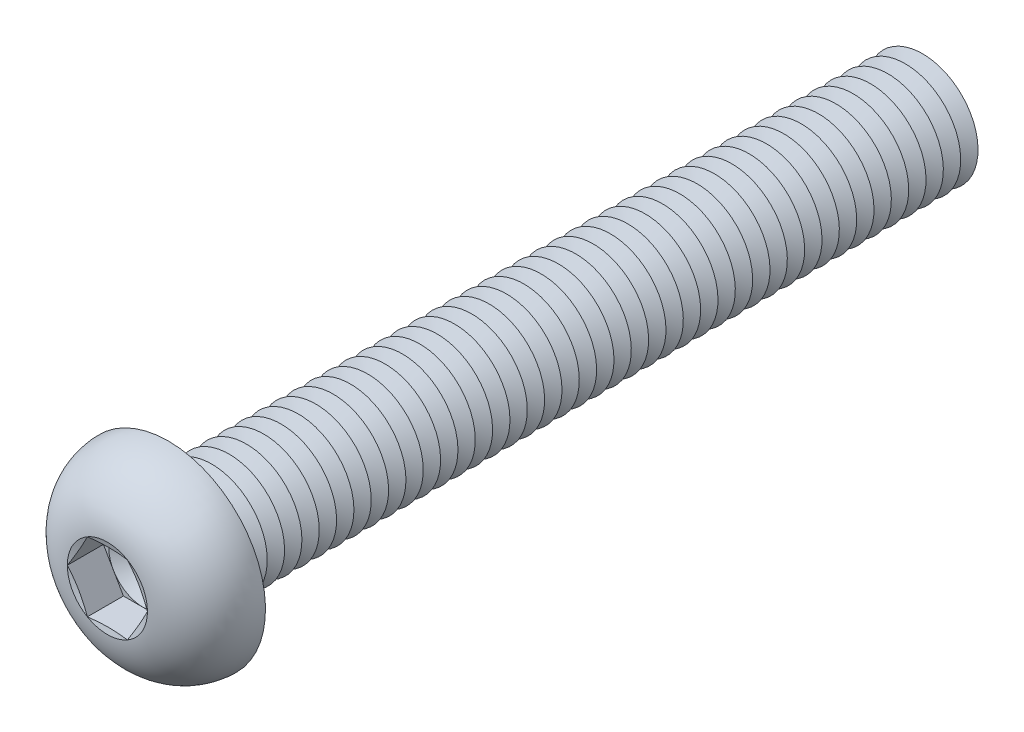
ISO-10303-21;
HEADER;
FILE_DESCRIPTION(('STEP AP214'),'2;1');
FILE_NAME('part.step','',(''),(''),'','','');
FILE_SCHEMA(('AUTOMOTIVE_DESIGN { 1 0 10303 214 1 1 1 1 }'));
ENDSEC;
DATA;
#1=APPLICATION_CONTEXT('core data for automotive mechanical design processes');
#2=APPLICATION_PROTOCOL_DEFINITION('international standard','automotive_design',2000,#1);
#3=PRODUCT_CONTEXT('',#1,'mechanical');
#4=PRODUCT('Part','Part','',(#3));
#5=PRODUCT_RELATED_PRODUCT_CATEGORY('part','',(#4));
#6=PRODUCT_DEFINITION_FORMATION('','',#4);
#7=PRODUCT_DEFINITION_CONTEXT('part definition',#1,'design');
#8=PRODUCT_DEFINITION('design','',#6,#7);
#9=PRODUCT_DEFINITION_SHAPE('','',#8);
#10=(LENGTH_UNIT() NAMED_UNIT(*) SI_UNIT(.MILLI.,.METRE.));
#11=(NAMED_UNIT(*) PLANE_ANGLE_UNIT() SI_UNIT($,.RADIAN.));
#12=(NAMED_UNIT(*) SI_UNIT($,.STERADIAN.) SOLID_ANGLE_UNIT());
#13=UNCERTAINTY_MEASURE_WITH_UNIT(LENGTH_MEASURE(1.E-05),#10,'distance_accuracy_value','');
#14=(GEOMETRIC_REPRESENTATION_CONTEXT(3) GLOBAL_UNCERTAINTY_ASSIGNED_CONTEXT((#13)) GLOBAL_UNIT_ASSIGNED_CONTEXT((#10,
#11,#12)) REPRESENTATION_CONTEXT('',''));
#15=CARTESIAN_POINT('',(0.,0.,0.));
#16=DIRECTION('',(0.,0.,1.));
#17=DIRECTION('',(1.,0.,0.));
#18=AXIS2_PLACEMENT_3D('',#15,#16,#17);
#19=CARTESIAN_POINT('',(0.,0.,1.8));
#20=DIRECTION('',(0.,0.,1.));
#21=DIRECTION('',(1.,0.,0.));
#22=AXIS2_PLACEMENT_3D('',#19,#20,#21);
#23=PLANE('',#22);
#24=CARTESIAN_POINT('',(0.,0.,1.8));
#25=DIRECTION('',(0.,0.,1.));
#26=DIRECTION('',(1.,0.,0.));
#27=AXIS2_PLACEMENT_3D('',#24,#25,#26);
#28=CIRCLE('',#27,2.49999883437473);
#29=CARTESIAN_POINT('',(2.1650625,1.24999941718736,1.8));
#30=VERTEX_POINT('',#29);
#31=CARTESIAN_POINT('',(0.,2.49999883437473,1.8));
#32=VERTEX_POINT('',#31);
#33=EDGE_CURVE('E118',#30,#32,#28,.T.);
#34=ORIENTED_EDGE('',*,*,#33,.F.);
#35=DIRECTION('',(-0.5,0.866025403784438,0.));
#36=VECTOR('',#35,1.);
#37=CARTESIAN_POINT('',(2.88675,0.,1.8));
#38=LINE('',#37,#36);
#39=CARTESIAN_POINT('',(1.443375,2.49999883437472,1.8));
#40=VERTEX_POINT('',#39);
#41=EDGE_CURVE('E125',#30,#40,#38,.T.);
#42=ORIENTED_EDGE('',*,*,#41,.T.);
#43=DIRECTION('',(-1.,0.,0.));
#44=VECTOR('',#43,1.);
#45=CARTESIAN_POINT('',(1.443375,2.49999883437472,1.8));
#46=LINE('',#45,#44);
#47=EDGE_CURVE('E136',#40,#32,#46,.T.);
#48=ORIENTED_EDGE('',*,*,#47,.T.);
#49=EDGE_LOOP('',(#34,#42,#48));
#50=FACE_BOUND('',#49,.T.);
#51=ADVANCED_FACE('F39',(#50),#23,.T.);
#52=CARTESIAN_POINT('',(0.,0.,1.8));
#53=DIRECTION('',(0.,0.,1.));
#54=DIRECTION('',(1.,0.,0.));
#55=AXIS2_PLACEMENT_3D('',#52,#53,#54);
#56=CIRCLE('',#55,2.49999883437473);
#57=CARTESIAN_POINT('',(-2.1650625,1.24999941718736,1.8));
#58=VERTEX_POINT('',#57);
#59=EDGE_CURVE('E11',#32,#58,#56,.T.);
#60=ORIENTED_EDGE('',*,*,#59,.F.);
#61=CARTESIAN_POINT('',(-1.443375,2.49999883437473,1.8));
#62=VERTEX_POINT('',#61);
#63=EDGE_CURVE('E131',#32,#62,#46,.T.);
#64=ORIENTED_EDGE('',*,*,#63,.T.);
#65=DIRECTION('',(-0.5,-0.866025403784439,0.));
#66=VECTOR('',#65,1.);
#67=CARTESIAN_POINT('',(-1.443375,2.49999883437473,1.8));
#68=LINE('',#67,#66);
#69=EDGE_CURVE('E134',#62,#58,#68,.T.);
#70=ORIENTED_EDGE('',*,*,#69,.T.);
#71=EDGE_LOOP('',(#60,#64,#70));
#72=FACE_BOUND('',#71,.T.);
#73=ADVANCED_FACE('F130',(#72),#23,.T.);
#74=CARTESIAN_POINT('',(-2.1650625,-1.24999941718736,1.8));
#75=VERTEX_POINT('',#74);
#76=EDGE_CURVE('E49',#58,#75,#56,.T.);
#77=ORIENTED_EDGE('',*,*,#76,.F.);
#78=CARTESIAN_POINT('',(-2.88675,0.,1.8));
#79=VERTEX_POINT('',#78);
#80=EDGE_CURVE('E143',#58,#79,#68,.T.);
#81=ORIENTED_EDGE('',*,*,#80,.T.);
#82=DIRECTION('',(0.5,-0.866025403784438,0.));
#83=VECTOR('',#82,1.);
#84=CARTESIAN_POINT('',(-2.88675,0.,1.8));
#85=LINE('',#84,#83);
#86=EDGE_CURVE('E152',#79,#75,#85,.T.);
#87=ORIENTED_EDGE('',*,*,#86,.T.);
#88=EDGE_LOOP('',(#77,#81,#87));
#89=FACE_BOUND('',#88,.T.);
#90=ADVANCED_FACE('F618',(#89),#23,.T.);
#91=CARTESIAN_POINT('',(0.,-2.49999883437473,1.8));
#92=VERTEX_POINT('',#91);
#93=EDGE_CURVE('E602',#75,#92,#56,.T.);
#94=ORIENTED_EDGE('',*,*,#93,.F.);
#95=CARTESIAN_POINT('',(-1.443375,-2.49999883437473,1.8));
#96=VERTEX_POINT('',#95);
#97=EDGE_CURVE('E151',#75,#96,#85,.T.);
#98=ORIENTED_EDGE('',*,*,#97,.T.);
#99=DIRECTION('',(1.,0.,0.));
#100=VECTOR('',#99,1.);
#101=CARTESIAN_POINT('',(-1.443375,-2.49999883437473,1.8));
#102=LINE('',#101,#100);
#103=EDGE_CURVE('E157',#96,#92,#102,.T.);
#104=ORIENTED_EDGE('',*,*,#103,.T.);
#105=EDGE_LOOP('',(#94,#98,#104));
#106=FACE_BOUND('',#105,.T.);
#107=ADVANCED_FACE('F611',(#106),#23,.T.);
#108=CARTESIAN_POINT('',(2.1650625,-1.24999941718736,1.8));
#109=VERTEX_POINT('',#108);
#110=EDGE_CURVE('E56',#92,#109,#56,.T.);
#111=ORIENTED_EDGE('',*,*,#110,.F.);
#112=CARTESIAN_POINT('',(1.443375,-2.49999883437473,1.8));
#113=VERTEX_POINT('',#112);
#114=EDGE_CURVE('E156',#92,#113,#102,.T.);
#115=ORIENTED_EDGE('',*,*,#114,.T.);
#116=DIRECTION('',(0.5,0.866025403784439,0.));
#117=VECTOR('',#116,1.);
#118=CARTESIAN_POINT('',(1.443375,-2.49999883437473,1.8));
#119=LINE('',#118,#117);
#120=EDGE_CURVE('E162',#113,#109,#119,.T.);
#121=ORIENTED_EDGE('',*,*,#120,.T.);
#122=EDGE_LOOP('',(#111,#115,#121));
#123=FACE_BOUND('',#122,.T.);
#124=ADVANCED_FACE('F688',(#123),#23,.T.);
#125=CARTESIAN_POINT('',(0.,0.,4.4));
#126=DIRECTION('',(0.,0.,1.));
#127=DIRECTION('',(0.,-1.,0.));
#128=AXIS2_PLACEMENT_3D('',#125,#126,#127);
#129=CONICAL_SURFACE('',#128,2.88675,1.30899693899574);
#130=CARTESIAN_POINT('',(2.88686547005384,-0.000200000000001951,4.40003094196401));
#131=CARTESIAN_POINT('',(2.82691617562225,0.103635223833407,4.3839595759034));
#132=CARTESIAN_POINT('',(2.76685817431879,0.20765873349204,4.36936933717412));
#133=CARTESIAN_POINT('',(2.64653003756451,0.416073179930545,4.3437355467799));
#134=CARTESIAN_POINT('',(2.58625982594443,0.520464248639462,4.33269343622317));
#135=CARTESIAN_POINT('',(2.46587274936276,0.72898078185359,4.31480063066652));
#136=CARTESIAN_POINT('',(2.40575669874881,0.833104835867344,4.3079285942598));
#137=CARTESIAN_POINT('',(2.28544792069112,1.04148575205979,4.29871388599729));
#138=CARTESIAN_POINT('',(2.22525521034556,1.14574258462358,4.29637033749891));
#139=CARTESIAN_POINT('',(2.10486978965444,1.35425624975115,4.29637033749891));
#140=CARTESIAN_POINT('',(2.04467707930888,1.45851308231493,4.29871388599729));
#141=CARTESIAN_POINT('',(1.92436830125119,1.66689399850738,4.3079285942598));
#142=CARTESIAN_POINT('',(1.86425225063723,1.77101805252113,4.31480063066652));
#143=CARTESIAN_POINT('',(1.74386517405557,1.97953458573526,4.33269343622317));
#144=CARTESIAN_POINT('',(1.68359496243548,2.08392565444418,4.3437355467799));
#145=CARTESIAN_POINT('',(1.56326682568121,2.29234010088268,4.36936933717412));
#146=CARTESIAN_POINT('',(1.50320882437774,2.39636361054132,4.3839595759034));
#147=CARTESIAN_POINT('',(1.44325952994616,2.50019883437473,4.40003094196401));
#148=B_SPLINE_CURVE_WITH_KNOTS('',3,(#130,#131,#132,#133,#134,#135,#136,#137,#138,#139,#140,
#141,#142,#143,#144,#145,#146,#147),.UNSPECIFIED.,.F.,.F.,(4,2,2,2,2,2,2,2,4),(0.,
0.362931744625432,0.726010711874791,1.08721550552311,1.44835036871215,1.80948523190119,
2.17069002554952,2.53376899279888,2.89670073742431),.UNSPECIFIED.);
#149=CARTESIAN_POINT('',(2.88675,0.,4.4));
#150=VERTEX_POINT('',#149);
#151=CARTESIAN_POINT('',(1.443375,2.49999883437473,4.4));
#152=VERTEX_POINT('',#151);
#153=EDGE_CURVE('E221',#150,#152,#148,.T.);
#154=ORIENTED_EDGE('',*,*,#153,.F.);
#155=CARTESIAN_POINT('',(0.,0.,4.4));
#156=DIRECTION('',(0.,0.,-1.));
#157=DIRECTION('',(0.,1.,0.));
#158=AXIS2_PLACEMENT_3D('',#155,#156,#157);
#159=CIRCLE('',#158,2.88675);
#160=EDGE_CURVE('E587',#152,#150,#159,.T.);
#161=ORIENTED_EDGE('',*,*,#160,.F.);
#162=EDGE_LOOP('',(#154,#161));
#163=FACE_BOUND('',#162,.T.);
#164=ADVANCED_FACE('F692',(#163),#129,.F.);
#165=CARTESIAN_POINT('',(1.44325952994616,-2.50019883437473,4.40003094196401));
#166=CARTESIAN_POINT('',(1.50320882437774,-2.39636361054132,4.3839595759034));
#167=CARTESIAN_POINT('',(1.56326682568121,-2.29234010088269,4.36936933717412));
#168=CARTESIAN_POINT('',(1.68359496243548,-2.08392565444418,4.3437355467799));
#169=CARTESIAN_POINT('',(1.74386517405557,-1.97953458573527,4.33269343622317));
#170=CARTESIAN_POINT('',(1.86425225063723,-1.77101805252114,4.31480063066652));
#171=CARTESIAN_POINT('',(1.92436830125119,-1.66689399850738,4.3079285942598));
#172=CARTESIAN_POINT('',(2.04467707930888,-1.45851308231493,4.29871388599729));
#173=CARTESIAN_POINT('',(2.10486978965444,-1.35425624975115,4.29637033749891));
#174=CARTESIAN_POINT('',(2.22525521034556,-1.14574258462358,4.29637033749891));
#175=CARTESIAN_POINT('',(2.28544792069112,-1.0414857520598,4.29871388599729));
#176=CARTESIAN_POINT('',(2.40575669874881,-0.833104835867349,4.3079285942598));
#177=CARTESIAN_POINT('',(2.46587274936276,-0.728980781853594,4.31480063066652));
#178=CARTESIAN_POINT('',(2.58625982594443,-0.520464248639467,4.33269343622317));
#179=CARTESIAN_POINT('',(2.64653003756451,-0.41607317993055,4.3437355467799));
#180=CARTESIAN_POINT('',(2.76685817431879,-0.207658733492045,4.36936933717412));
#181=CARTESIAN_POINT('',(2.82691617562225,-0.103635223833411,4.3839595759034));
#182=CARTESIAN_POINT('',(2.88686547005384,0.000199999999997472,4.40003094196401));
#183=B_SPLINE_CURVE_WITH_KNOTS('',3,(#165,#166,#167,#168,#169,#170,#171,#172,#173,#174,#175,
#176,#177,#178,#179,#180,#181,#182),.UNSPECIFIED.,.F.,.F.,(4,2,2,2,2,2,2,2,4),(0.,
0.362931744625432,0.726010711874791,1.08721550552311,1.44835036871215,1.80948523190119,
2.17069002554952,2.53376899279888,2.89670073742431),.UNSPECIFIED.);
#184=CARTESIAN_POINT('',(1.443375,-2.49999883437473,4.4));
#185=VERTEX_POINT('',#184);
#186=EDGE_CURVE('E230',#185,#150,#183,.T.);
#187=ORIENTED_EDGE('',*,*,#186,.F.);
#188=EDGE_CURVE('E592',#150,#185,#159,.T.);
#189=ORIENTED_EDGE('',*,*,#188,.F.);
#190=EDGE_LOOP('',(#187,#189));
#191=FACE_BOUND('',#190,.T.);
#192=ADVANCED_FACE('F653',(#191),#129,.F.);
#193=CARTESIAN_POINT('',(-4.35611719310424,-2.49999883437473,4.97227902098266));
#194=CARTESIAN_POINT('',(-4.25066509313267,-2.49999883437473,4.94777440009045));
#195=CARTESIAN_POINT('',(-4.14516541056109,-2.49999883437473,4.92347459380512));
#196=CARTESIAN_POINT('',(-3.93405094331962,-2.49999883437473,4.87537247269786));
#197=CARTESIAN_POINT('',(-3.82843615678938,-2.49999883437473,4.85157016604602));
#198=CARTESIAN_POINT('',(-3.5113534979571,-2.49999883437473,4.78103338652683));
#199=CARTESIAN_POINT('',(-3.29968815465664,-2.49999883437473,4.73517861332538));
#200=CARTESIAN_POINT('',(-2.87365524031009,-2.49999883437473,4.64645582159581));
#201=CARTESIAN_POINT('',(-2.65928093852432,-2.49999883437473,4.60361983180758));
#202=CARTESIAN_POINT('',(-2.22952626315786,-2.49999883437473,4.52311285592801));
#203=CARTESIAN_POINT('',(-2.01414580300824,-2.49999883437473,4.48544232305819));
#204=CARTESIAN_POINT('',(-1.58798319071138,-2.49999883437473,4.41876559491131));
#205=CARTESIAN_POINT('',(-1.37723418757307,-2.49999883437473,4.38955265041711));
#206=CARTESIAN_POINT('',(-0.954530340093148,-2.49999883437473,4.34171384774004));
#207=CARTESIAN_POINT('',(-0.742575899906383,-2.49999883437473,4.32308463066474));
#208=CARTESIAN_POINT('',(-0.424544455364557,-2.49999883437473,4.30539140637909));
#209=CARTESIAN_POINT('',(-0.318745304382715,-2.49999883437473,4.30120018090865));
#210=CARTESIAN_POINT('',(-0.107062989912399,-2.49999883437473,4.29638997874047));
#211=CARTESIAN_POINT('',(-0.00117982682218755,-2.49999883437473,4.29577098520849));
#212=CARTESIAN_POINT('',(0.210552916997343,-2.49999883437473,4.29814378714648));
#213=CARTESIAN_POINT('',(0.316402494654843,-2.49999883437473,4.30113585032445));
#214=CARTESIAN_POINT('',(0.527944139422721,-2.49999883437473,4.31057322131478));
#215=CARTESIAN_POINT('',(0.633636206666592,-2.49999883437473,4.31701852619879));
#216=CARTESIAN_POINT('',(0.890304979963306,-2.49999883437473,4.33652018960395));
#217=CARTESIAN_POINT('',(1.0411561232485,-2.49999883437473,4.35122885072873));
#218=CARTESIAN_POINT('',(1.34222474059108,-2.49999883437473,4.38593609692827));
#219=CARTESIAN_POINT('',(1.49244223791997,-2.49999883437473,4.40593448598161));
#220=CARTESIAN_POINT('',(1.79273634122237,-2.49999883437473,4.45011321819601));
#221=CARTESIAN_POINT('',(1.94281100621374,-2.49999883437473,4.47430656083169));
#222=CARTESIAN_POINT('',(2.24242097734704,-2.49999883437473,4.52583552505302));
#223=CARTESIAN_POINT('',(2.39195625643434,-2.49999883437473,4.55317130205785));
#224=CARTESIAN_POINT('',(2.69364402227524,-2.49999883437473,4.61079781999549));
#225=CARTESIAN_POINT('',(2.8457870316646,-2.49999883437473,4.64113779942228));
#226=CARTESIAN_POINT('',(3.14969016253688,-2.49999883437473,4.70367638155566));
#227=CARTESIAN_POINT('',(3.30145027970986,-2.49999883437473,4.73587500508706));
#228=CARTESIAN_POINT('',(3.60383766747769,-2.49999883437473,4.80150275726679));
#229=CARTESIAN_POINT('',(3.75446660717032,-2.49999883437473,4.83492423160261));
#230=CARTESIAN_POINT('',(4.05546753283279,-2.49999883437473,4.90285814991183));
#231=CARTESIAN_POINT('',(4.2058395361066,-2.49999883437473,4.9373705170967));
#232=CARTESIAN_POINT('',(4.35611719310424,-2.49999883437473,4.97227902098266));
#233=B_SPLINE_CURVE_WITH_KNOTS('',3,(#193,#194,#195,#196,#197,#198,#199,#200,#201,#202,#203,
#204,#205,#206,#207,#208,#209,#210,#211,#212,#213,#214,#215,#216,#217,#218,#219,#220,#221,#222,
#223,#224,#225,#226,#227,#228,#229,#230,#231,#232),.UNSPECIFIED.,.F.,.F.,(4,2,2,2,2,2,2,2,2,2,2,
2,2,2,2,2,2,2,2,4),(0.,0.324785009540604,0.6495753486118,1.29928181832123,1.95507889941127,
2.61093348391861,3.24905289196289,3.88696967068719,4.204563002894,4.5221548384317,
4.83977022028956,5.15738533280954,5.61196030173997,6.06651842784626,6.52251118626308,
6.97852650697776,7.44392737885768,7.90933346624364,8.37220553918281,8.83504510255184),.UNSPECIFIED.);
#234=CARTESIAN_POINT('',(-1.443375,-2.49999883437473,4.4));
#235=VERTEX_POINT('',#234);
#236=EDGE_CURVE('E632',#235,#185,#233,.T.);
#237=ORIENTED_EDGE('',*,*,#236,.F.);
#238=EDGE_CURVE('E645',#185,#235,#159,.T.);
#239=ORIENTED_EDGE('',*,*,#238,.F.);
#240=EDGE_LOOP('',(#237,#239));
#241=FACE_BOUND('',#240,.T.);
#242=ADVANCED_FACE('F659',(#241),#129,.F.);
#243=CARTESIAN_POINT('',(-2.88686547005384,0.000199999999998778,4.40003094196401));
#244=CARTESIAN_POINT('',(-2.82691617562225,-0.103635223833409,4.3839595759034));
#245=CARTESIAN_POINT('',(-2.76685817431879,-0.207658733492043,4.36936933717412));
#246=CARTESIAN_POINT('',(-2.64653003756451,-0.416073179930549,4.3437355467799));
#247=CARTESIAN_POINT('',(-2.58625982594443,-0.520464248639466,4.33269343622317));
#248=CARTESIAN_POINT('',(-2.46587274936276,-0.728980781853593,4.31480063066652));
#249=CARTESIAN_POINT('',(-2.40575669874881,-0.833104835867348,4.3079285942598));
#250=CARTESIAN_POINT('',(-2.28544792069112,-1.0414857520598,4.29871388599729));
#251=CARTESIAN_POINT('',(-2.22525521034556,-1.14574258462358,4.29637033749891));
#252=CARTESIAN_POINT('',(-2.10486978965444,-1.35425624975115,4.29637033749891));
#253=CARTESIAN_POINT('',(-2.04467707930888,-1.45851308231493,4.29871388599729));
#254=CARTESIAN_POINT('',(-1.92436830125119,-1.66689399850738,4.3079285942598));
#255=CARTESIAN_POINT('',(-1.86425225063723,-1.77101805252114,4.31480063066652));
#256=CARTESIAN_POINT('',(-1.74386517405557,-1.97953458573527,4.33269343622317));
#257=CARTESIAN_POINT('',(-1.68359496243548,-2.08392565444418,4.3437355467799));
#258=CARTESIAN_POINT('',(-1.56326682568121,-2.29234010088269,4.36936933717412));
#259=CARTESIAN_POINT('',(-1.50320882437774,-2.39636361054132,4.3839595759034));
#260=CARTESIAN_POINT('',(-1.44325952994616,-2.50019883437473,4.40003094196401));
#261=B_SPLINE_CURVE_WITH_KNOTS('',3,(#243,#244,#245,#246,#247,#248,#249,#250,#251,#252,#253,
#254,#255,#256,#257,#258,#259,#260),.UNSPECIFIED.,.F.,.F.,(4,2,2,2,2,2,2,2,4),(0.,
0.362931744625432,0.726010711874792,1.08721550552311,1.44835036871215,1.80948523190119,
2.17069002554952,2.53376899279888,2.89670073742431),.UNSPECIFIED.);
#262=CARTESIAN_POINT('',(-2.88675,0.,4.4));
#263=VERTEX_POINT('',#262);
#264=EDGE_CURVE('E623',#263,#235,#261,.T.);
#265=ORIENTED_EDGE('',*,*,#264,.F.);
#266=EDGE_CURVE('E629',#235,#263,#159,.T.);
#267=ORIENTED_EDGE('',*,*,#266,.F.);
#268=EDGE_LOOP('',(#265,#267));
#269=FACE_BOUND('',#268,.T.);
#270=ADVANCED_FACE('F627',(#269),#129,.F.);
#271=CARTESIAN_POINT('',(-1.44325952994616,2.50019883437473,4.40003094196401));
#272=CARTESIAN_POINT('',(-1.50320882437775,2.39636361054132,4.3839595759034));
#273=CARTESIAN_POINT('',(-1.56326682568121,2.29234010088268,4.36936933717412));
#274=CARTESIAN_POINT('',(-1.68359496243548,2.08392565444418,4.3437355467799));
#275=CARTESIAN_POINT('',(-1.74386517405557,1.97953458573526,4.33269343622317));
#276=CARTESIAN_POINT('',(-1.86425225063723,1.77101805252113,4.31480063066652));
#277=CARTESIAN_POINT('',(-1.92436830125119,1.66689399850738,4.3079285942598));
#278=CARTESIAN_POINT('',(-2.04467707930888,1.45851308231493,4.29871388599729));
#279=CARTESIAN_POINT('',(-2.10486978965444,1.35425624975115,4.29637033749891));
#280=CARTESIAN_POINT('',(-2.22525521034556,1.14574258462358,4.29637033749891));
#281=CARTESIAN_POINT('',(-2.28544792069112,1.04148575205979,4.29871388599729));
#282=CARTESIAN_POINT('',(-2.40575669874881,0.833104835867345,4.3079285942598));
#283=CARTESIAN_POINT('',(-2.46587274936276,0.728980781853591,4.31480063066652));
#284=CARTESIAN_POINT('',(-2.58625982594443,0.520464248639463,4.33269343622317));
#285=CARTESIAN_POINT('',(-2.64653003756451,0.416073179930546,4.3437355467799));
#286=CARTESIAN_POINT('',(-2.76685817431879,0.207658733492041,4.36936933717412));
#287=CARTESIAN_POINT('',(-2.82691617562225,0.103635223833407,4.3839595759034));
#288=CARTESIAN_POINT('',(-2.88686547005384,-0.000200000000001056,4.40003094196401));
#289=B_SPLINE_CURVE_WITH_KNOTS('',3,(#271,#272,#273,#274,#275,#276,#277,#278,#279,#280,#281,
#282,#283,#284,#285,#286,#287,#288),.UNSPECIFIED.,.F.,.F.,(4,2,2,2,2,2,2,2,4),(0.,
0.362931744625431,0.72601071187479,1.08721550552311,1.44835036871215,1.80948523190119,
2.17069002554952,2.53376899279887,2.89670073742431),.UNSPECIFIED.);
#290=CARTESIAN_POINT('',(-1.443375,2.49999883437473,4.4));
#291=VERTEX_POINT('',#290);
#292=EDGE_CURVE('E195',#291,#263,#289,.T.);
#293=ORIENTED_EDGE('',*,*,#292,.F.);
#294=EDGE_CURVE('E635',#263,#291,#159,.T.);
#295=ORIENTED_EDGE('',*,*,#294,.F.);
#296=EDGE_LOOP('',(#293,#295));
#297=FACE_BOUND('',#296,.T.);
#298=ADVANCED_FACE('F636',(#297),#129,.F.);
#299=CARTESIAN_POINT('',(0.,0.,-50.625));
#300=DIRECTION('',(0.,0.,1.));
#301=DIRECTION('',(0.,-1.,0.));
#302=AXIS2_PLACEMENT_3D('',#299,#300,#301);
#303=CONICAL_SURFACE('',#302,3.99999999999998,1.0471975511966);
#304=CARTESIAN_POINT('',(0.,0.,-51.25));
#305=DIRECTION('',(0.,0.,1.));
#306=DIRECTION('',(0.,-1.,0.));
#307=AXIS2_PLACEMENT_3D('',#304,#305,#306);
#308=CIRCLE('',#307,2.91746824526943);
#309=CARTESIAN_POINT('',(0.,-2.91746824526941,-51.25));
#310=VERTEX_POINT('',#309);
#311=EDGE_CURVE('E559',#310,#310,#308,.T.);
#312=ORIENTED_EDGE('',*,*,#311,.T.);
#313=EDGE_LOOP('',(#312));
#314=FACE_BOUND('',#313,.T.);
#315=CARTESIAN_POINT('',(0.,0.,-50.625));
#316=DIRECTION('',(0.,0.,1.));
#317=DIRECTION('',(0.,-1.,0.));
#318=AXIS2_PLACEMENT_3D('',#315,#316,#317);
#319=CIRCLE('',#318,3.99999999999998);
#320=CARTESIAN_POINT('',(0.,-3.99999999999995,-50.625));
#321=VERTEX_POINT('',#320);
#322=EDGE_CURVE('E555',#321,#321,#319,.T.);
#323=ORIENTED_EDGE('',*,*,#322,.F.);
#324=EDGE_LOOP('',(#323));
#325=FACE_BOUND('',#324,.T.);
#326=ADVANCED_FACE('F719',(#314,#325),#303,.T.);
#327=CARTESIAN_POINT('',(0.,0.,-51.25));
#328=DIRECTION('',(0.,0.,-1.));
#329=DIRECTION('',(0.,1.,0.));
#330=AXIS2_PLACEMENT_3D('',#327,#328,#329);
#331=CONICAL_SURFACE('',#330,2.91746824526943,1.0471975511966);
#332=CARTESIAN_POINT('',(0.,0.,-51.875));
#333=DIRECTION('',(0.,0.,1.));
#334=DIRECTION('',(0.,-1.,0.));
#335=AXIS2_PLACEMENT_3D('',#332,#333,#334);
#336=CIRCLE('',#335,3.99999999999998);
#337=CARTESIAN_POINT('',(0.,-3.99999999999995,-51.875));
#338=VERTEX_POINT('',#337);
#339=EDGE_CURVE('E563',#338,#338,#336,.T.);
#340=ORIENTED_EDGE('',*,*,#339,.T.);
#341=EDGE_LOOP('',(#340));
#342=FACE_BOUND('',#341,.T.);
#343=ORIENTED_EDGE('',*,*,#311,.F.);
#344=EDGE_LOOP('',(#343));
#345=FACE_BOUND('',#344,.T.);
#346=ADVANCED_FACE('F724',(#342,#345),#331,.T.);
#347=CARTESIAN_POINT('',(0.,3.99999999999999,-55.));
#348=DIRECTION('',(0.,0.,-1.));
#349=DIRECTION('',(0.,1.,0.));
#350=AXIS2_PLACEMENT_3D('',#347,#348,#349);
#351=PLANE('',#350);
#352=CARTESIAN_POINT('',(0.,0.,-55.));
#353=DIRECTION('',(0.,0.,1.));
#354=DIRECTION('',(0.,-1.,0.));
#355=AXIS2_PLACEMENT_3D('',#352,#353,#354);
#356=CIRCLE('',#355,2.91746824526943);
#357=CARTESIAN_POINT('',(0.,-2.9174682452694,-55.));
#358=VERTEX_POINT('',#357);
#359=EDGE_CURVE('E582',#358,#358,#356,.T.);
#360=ORIENTED_EDGE('',*,*,#359,.F.);
#361=EDGE_LOOP('',(#360));
#362=FACE_BOUND('',#361,.T.);
#363=ADVANCED_FACE('F891',(#362),#351,.T.);
#364=CARTESIAN_POINT('',(0.,0.,-54.375));
#365=DIRECTION('',(0.,0.,1.));
#366=DIRECTION('',(0.,-1.,0.));
#367=AXIS2_PLACEMENT_3D('',#364,#365,#366);
#368=CONICAL_SURFACE('',#367,3.99999999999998,1.0471975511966);
#369=ORIENTED_EDGE('',*,*,#359,.T.);
#370=EDGE_LOOP('',(#369));
#371=FACE_BOUND('',#370,.T.);
#372=CARTESIAN_POINT('',(0.,0.,-54.375));
#373=DIRECTION('',(0.,0.,1.));
#374=DIRECTION('',(0.,-1.,0.));
#375=AXIS2_PLACEMENT_3D('',#372,#373,#374);
#376=CIRCLE('',#375,3.99999999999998);
#377=CARTESIAN_POINT('',(0.,-3.99999999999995,-54.375));
#378=VERTEX_POINT('',#377);
#379=EDGE_CURVE('E578',#378,#378,#376,.T.);
#380=ORIENTED_EDGE('',*,*,#379,.F.);
#381=EDGE_LOOP('',(#380));
#382=FACE_BOUND('',#381,.T.);
#383=ADVANCED_FACE('F884',(#371,#382),#368,.T.);
#384=CARTESIAN_POINT('',(0.,0.,-53.75));
#385=DIRECTION('',(0.,0.,-1.));
#386=DIRECTION('',(0.,1.,0.));
#387=AXIS2_PLACEMENT_3D('',#384,#385,#386);
#388=CONICAL_SURFACE('',#387,2.91746824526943,1.0471975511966);
#389=ORIENTED_EDGE('',*,*,#379,.T.);
#390=EDGE_LOOP('',(#389));
#391=FACE_BOUND('',#390,.T.);
#392=CARTESIAN_POINT('',(0.,0.,-53.75));
#393=DIRECTION('',(0.,0.,1.));
#394=DIRECTION('',(0.,-1.,0.));
#395=AXIS2_PLACEMENT_3D('',#392,#393,#394);
#396=CIRCLE('',#395,2.91746824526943);
#397=CARTESIAN_POINT('',(0.,-2.9174682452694,-53.75));
#398=VERTEX_POINT('',#397);
#399=EDGE_CURVE('E574',#398,#398,#396,.T.);
#400=ORIENTED_EDGE('',*,*,#399,.F.);
#401=EDGE_LOOP('',(#400));
#402=FACE_BOUND('',#401,.T.);
#403=ADVANCED_FACE('F890',(#391,#402),#388,.T.);
#404=CARTESIAN_POINT('',(0.,0.,-53.125));
#405=DIRECTION('',(0.,0.,1.));
#406=DIRECTION('',(0.,-1.,0.));
#407=AXIS2_PLACEMENT_3D('',#404,#405,#406);
#408=CONICAL_SURFACE('',#407,3.99999999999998,1.0471975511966);
#409=ORIENTED_EDGE('',*,*,#399,.T.);
#410=EDGE_LOOP('',(#409));
#411=FACE_BOUND('',#410,.T.);
#412=CARTESIAN_POINT('',(0.,0.,-53.125));
#413=DIRECTION('',(0.,0.,1.));
#414=DIRECTION('',(0.,-1.,0.));
#415=AXIS2_PLACEMENT_3D('',#412,#413,#414);
#416=CIRCLE('',#415,3.99999999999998);
#417=CARTESIAN_POINT('',(0.,-3.99999999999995,-53.125));
#418=VERTEX_POINT('',#417);
#419=EDGE_CURVE('E570',#418,#418,#416,.T.);
#420=ORIENTED_EDGE('',*,*,#419,.F.);
#421=EDGE_LOOP('',(#420));
#422=FACE_BOUND('',#421,.T.);
#423=ADVANCED_FACE('F922',(#411,#422),#408,.T.);
#424=CARTESIAN_POINT('',(0.,0.,-52.5));
#425=DIRECTION('',(0.,0.,-1.));
#426=DIRECTION('',(0.,1.,0.));
#427=AXIS2_PLACEMENT_3D('',#424,#425,#426);
#428=CONICAL_SURFACE('',#427,2.91746824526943,1.0471975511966);
#429=ORIENTED_EDGE('',*,*,#419,.T.);
#430=EDGE_LOOP('',(#429));
#431=FACE_BOUND('',#430,.T.);
#432=CARTESIAN_POINT('',(0.,0.,-52.5));
#433=DIRECTION('',(0.,0.,1.));
#434=DIRECTION('',(0.,-1.,0.));
#435=AXIS2_PLACEMENT_3D('',#432,#433,#434);
#436=CIRCLE('',#435,2.91746824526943);
#437=CARTESIAN_POINT('',(0.,-2.9174682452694,-52.5));
#438=VERTEX_POINT('',#437);
#439=EDGE_CURVE('E566',#438,#438,#436,.T.);
#440=ORIENTED_EDGE('',*,*,#439,.F.);
#441=EDGE_LOOP('',(#440));
#442=FACE_BOUND('',#441,.T.);
#443=ADVANCED_FACE('F932',(#431,#442),#428,.T.);
#444=CARTESIAN_POINT('',(0.,0.,-51.875));
#445=DIRECTION('',(0.,0.,1.));
#446=DIRECTION('',(0.,-1.,0.));
#447=AXIS2_PLACEMENT_3D('',#444,#445,#446);
#448=CONICAL_SURFACE('',#447,3.99999999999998,1.0471975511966);
#449=ORIENTED_EDGE('',*,*,#439,.T.);
#450=EDGE_LOOP('',(#449));
#451=FACE_BOUND('',#450,.T.);
#452=ORIENTED_EDGE('',*,*,#339,.F.);
#453=EDGE_LOOP('',(#452));
#454=FACE_BOUND('',#453,.T.);
#455=ADVANCED_FACE('F942',(#451,#454),#448,.T.);
#456=CARTESIAN_POINT('',(0.,0.,-49.375));
#457=DIRECTION('',(0.,0.,1.));
#458=DIRECTION('',(0.,-1.,0.));
#459=AXIS2_PLACEMENT_3D('',#456,#457,#458);
#460=CONICAL_SURFACE('',#459,3.99999999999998,1.0471975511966);
#461=CARTESIAN_POINT('',(0.,0.,-50.));
#462=DIRECTION('',(0.,0.,1.));
#463=DIRECTION('',(0.,-1.,0.));
#464=AXIS2_PLACEMENT_3D('',#461,#462,#463);
#465=CIRCLE('',#464,2.91746824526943);
#466=CARTESIAN_POINT('',(0.,-2.91746824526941,-50.));
#467=VERTEX_POINT('',#466);
#468=EDGE_CURVE('E551',#467,#467,#465,.T.);
#469=ORIENTED_EDGE('',*,*,#468,.T.);
#470=EDGE_LOOP('',(#469));
#471=FACE_BOUND('',#470,.T.);
#472=CARTESIAN_POINT('',(0.,0.,-49.375));
#473=DIRECTION('',(0.,0.,1.));
#474=DIRECTION('',(0.,-1.,0.));
#475=AXIS2_PLACEMENT_3D('',#472,#473,#474);
#476=CIRCLE('',#475,3.99999999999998);
#477=CARTESIAN_POINT('',(0.,-3.99999999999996,-49.375));
#478=VERTEX_POINT('',#477);
#479=EDGE_CURVE('E547',#478,#478,#476,.T.);
#480=ORIENTED_EDGE('',*,*,#479,.F.);
#481=EDGE_LOOP('',(#480));
#482=FACE_BOUND('',#481,.T.);
#483=ADVANCED_FACE('F952',(#471,#482),#460,.T.);
#484=CARTESIAN_POINT('',(0.,0.,-50.));
#485=DIRECTION('',(0.,0.,-1.));
#486=DIRECTION('',(0.,1.,0.));
#487=AXIS2_PLACEMENT_3D('',#484,#485,#486);
#488=CONICAL_SURFACE('',#487,2.91746824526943,1.0471975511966);
#489=ORIENTED_EDGE('',*,*,#322,.T.);
#490=EDGE_LOOP('',(#489));
#491=FACE_BOUND('',#490,.T.);
#492=ORIENTED_EDGE('',*,*,#468,.F.);
#493=EDGE_LOOP('',(#492));
#494=FACE_BOUND('',#493,.T.);
#495=ADVANCED_FACE('F962',(#491,#494),#488,.T.);
#496=CARTESIAN_POINT('',(0.,0.,-48.125));
#497=DIRECTION('',(0.,0.,1.));
#498=DIRECTION('',(0.,-1.,0.));
#499=AXIS2_PLACEMENT_3D('',#496,#497,#498);
#500=CONICAL_SURFACE('',#499,3.99999999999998,1.0471975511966);
#501=CARTESIAN_POINT('',(0.,0.,-48.75));
#502=DIRECTION('',(0.,0.,1.));
#503=DIRECTION('',(0.,-1.,0.));
#504=AXIS2_PLACEMENT_3D('',#501,#502,#503);
#505=CIRCLE('',#504,2.91746824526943);
#506=CARTESIAN_POINT('',(0.,-2.91746824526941,-48.75));
#507=VERTEX_POINT('',#506);
#508=EDGE_CURVE('E543',#507,#507,#505,.T.);
#509=ORIENTED_EDGE('',*,*,#508,.T.);
#510=EDGE_LOOP('',(#509));
#511=FACE_BOUND('',#510,.T.);
#512=CARTESIAN_POINT('',(0.,0.,-48.125));
#513=DIRECTION('',(0.,0.,1.));
#514=DIRECTION('',(0.,-1.,0.));
#515=AXIS2_PLACEMENT_3D('',#512,#513,#514);
#516=CIRCLE('',#515,3.99999999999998);
#517=CARTESIAN_POINT('',(0.,-3.99999999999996,-48.125));
#518=VERTEX_POINT('',#517);
#519=EDGE_CURVE('E539',#518,#518,#516,.T.);
#520=ORIENTED_EDGE('',*,*,#519,.F.);
#521=EDGE_LOOP('',(#520));
#522=FACE_BOUND('',#521,.T.);
#523=ADVANCED_FACE('F972',(#511,#522),#500,.T.);
#524=CARTESIAN_POINT('',(0.,0.,-48.75));
#525=DIRECTION('',(0.,0.,-1.));
#526=DIRECTION('',(0.,1.,0.));
#527=AXIS2_PLACEMENT_3D('',#524,#525,#526);
#528=CONICAL_SURFACE('',#527,2.91746824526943,1.0471975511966);
#529=ORIENTED_EDGE('',*,*,#479,.T.);
#530=EDGE_LOOP('',(#529));
#531=FACE_BOUND('',#530,.T.);
#532=ORIENTED_EDGE('',*,*,#508,.F.);
#533=EDGE_LOOP('',(#532));
#534=FACE_BOUND('',#533,.T.);
#535=ADVANCED_FACE('F982',(#531,#534),#528,.T.);
#536=CARTESIAN_POINT('',(0.,0.,-46.875));
#537=DIRECTION('',(0.,0.,1.));
#538=DIRECTION('',(0.,-1.,0.));
#539=AXIS2_PLACEMENT_3D('',#536,#537,#538);
#540=CONICAL_SURFACE('',#539,3.99999999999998,1.0471975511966);
#541=CARTESIAN_POINT('',(0.,0.,-47.5));
#542=DIRECTION('',(0.,0.,1.));
#543=DIRECTION('',(0.,-1.,0.));
#544=AXIS2_PLACEMENT_3D('',#541,#542,#543);
#545=CIRCLE('',#544,2.91746824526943);
#546=CARTESIAN_POINT('',(0.,-2.91746824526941,-47.5));
#547=VERTEX_POINT('',#546);
#548=EDGE_CURVE('E535',#547,#547,#545,.T.);
#549=ORIENTED_EDGE('',*,*,#548,.T.);
#550=EDGE_LOOP('',(#549));
#551=FACE_BOUND('',#550,.T.);
#552=CARTESIAN_POINT('',(0.,0.,-46.875));
#553=DIRECTION('',(0.,0.,1.));
#554=DIRECTION('',(0.,-1.,0.));
#555=AXIS2_PLACEMENT_3D('',#552,#553,#554);
#556=CIRCLE('',#555,3.99999999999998);
#557=CARTESIAN_POINT('',(0.,-3.99999999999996,-46.875));
#558=VERTEX_POINT('',#557);
#559=EDGE_CURVE('E531',#558,#558,#556,.T.);
#560=ORIENTED_EDGE('',*,*,#559,.F.);
#561=EDGE_LOOP('',(#560));
#562=FACE_BOUND('',#561,.T.);
#563=ADVANCED_FACE('F992',(#551,#562),#540,.T.);
#564=CARTESIAN_POINT('',(0.,0.,-47.5));
#565=DIRECTION('',(0.,0.,-1.));
#566=DIRECTION('',(0.,1.,0.));
#567=AXIS2_PLACEMENT_3D('',#564,#565,#566);
#568=CONICAL_SURFACE('',#567,2.91746824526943,1.0471975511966);
#569=ORIENTED_EDGE('',*,*,#519,.T.);
#570=EDGE_LOOP('',(#569));
#571=FACE_BOUND('',#570,.T.);
#572=ORIENTED_EDGE('',*,*,#548,.F.);
#573=EDGE_LOOP('',(#572));
#574=FACE_BOUND('',#573,.T.);
#575=ADVANCED_FACE('F1002',(#571,#574),#568,.T.);
#576=CARTESIAN_POINT('',(0.,0.,-45.625));
#577=DIRECTION('',(0.,0.,1.));
#578=DIRECTION('',(0.,-1.,0.));
#579=AXIS2_PLACEMENT_3D('',#576,#577,#578);
#580=CONICAL_SURFACE('',#579,3.99999999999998,1.0471975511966);
#581=CARTESIAN_POINT('',(0.,0.,-46.25));
#582=DIRECTION('',(0.,0.,1.));
#583=DIRECTION('',(0.,-1.,0.));
#584=AXIS2_PLACEMENT_3D('',#581,#582,#583);
#585=CIRCLE('',#584,2.91746824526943);
#586=CARTESIAN_POINT('',(0.,-2.91746824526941,-46.25));
#587=VERTEX_POINT('',#586);
#588=EDGE_CURVE('E527',#587,#587,#585,.T.);
#589=ORIENTED_EDGE('',*,*,#588,.T.);
#590=EDGE_LOOP('',(#589));
#591=FACE_BOUND('',#590,.T.);
#592=CARTESIAN_POINT('',(0.,0.,-45.625));
#593=DIRECTION('',(0.,0.,1.));
#594=DIRECTION('',(0.,-1.,0.));
#595=AXIS2_PLACEMENT_3D('',#592,#593,#594);
#596=CIRCLE('',#595,3.99999999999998);
#597=CARTESIAN_POINT('',(0.,-3.99999999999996,-45.625));
#598=VERTEX_POINT('',#597);
#599=EDGE_CURVE('E523',#598,#598,#596,.T.);
#600=ORIENTED_EDGE('',*,*,#599,.F.);
#601=EDGE_LOOP('',(#600));
#602=FACE_BOUND('',#601,.T.);
#603=ADVANCED_FACE('F1012',(#591,#602),#580,.T.);
#604=CARTESIAN_POINT('',(0.,0.,-46.25));
#605=DIRECTION('',(0.,0.,-1.));
#606=DIRECTION('',(0.,1.,0.));
#607=AXIS2_PLACEMENT_3D('',#604,#605,#606);
#608=CONICAL_SURFACE('',#607,2.91746824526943,1.0471975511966);
#609=ORIENTED_EDGE('',*,*,#559,.T.);
#610=EDGE_LOOP('',(#609));
#611=FACE_BOUND('',#610,.T.);
#612=ORIENTED_EDGE('',*,*,#588,.F.);
#613=EDGE_LOOP('',(#612));
#614=FACE_BOUND('',#613,.T.);
#615=ADVANCED_FACE('F1022',(#611,#614),#608,.T.);
#616=CARTESIAN_POINT('',(0.,0.,-44.375));
#617=DIRECTION('',(0.,0.,1.));
#618=DIRECTION('',(0.,-1.,0.));
#619=AXIS2_PLACEMENT_3D('',#616,#617,#618);
#620=CONICAL_SURFACE('',#619,3.99999999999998,1.0471975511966);
#621=CARTESIAN_POINT('',(0.,0.,-45.));
#622=DIRECTION('',(0.,0.,1.));
#623=DIRECTION('',(0.,-1.,0.));
#624=AXIS2_PLACEMENT_3D('',#621,#622,#623);
#625=CIRCLE('',#624,2.91746824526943);
#626=CARTESIAN_POINT('',(0.,-2.91746824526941,-45.));
#627=VERTEX_POINT('',#626);
#628=EDGE_CURVE('E519',#627,#627,#625,.T.);
#629=ORIENTED_EDGE('',*,*,#628,.T.);
#630=EDGE_LOOP('',(#629));
#631=FACE_BOUND('',#630,.T.);
#632=CARTESIAN_POINT('',(0.,0.,-44.375));
#633=DIRECTION('',(0.,0.,1.));
#634=DIRECTION('',(0.,-1.,0.));
#635=AXIS2_PLACEMENT_3D('',#632,#633,#634);
#636=CIRCLE('',#635,3.99999999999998);
#637=CARTESIAN_POINT('',(0.,-3.99999999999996,-44.375));
#638=VERTEX_POINT('',#637);
#639=EDGE_CURVE('E515',#638,#638,#636,.T.);
#640=ORIENTED_EDGE('',*,*,#639,.F.);
#641=EDGE_LOOP('',(#640));
#642=FACE_BOUND('',#641,.T.);
#643=ADVANCED_FACE('F1032',(#631,#642),#620,.T.);
#644=CARTESIAN_POINT('',(0.,0.,-45.));
#645=DIRECTION('',(0.,0.,-1.));
#646=DIRECTION('',(0.,1.,0.));
#647=AXIS2_PLACEMENT_3D('',#644,#645,#646);
#648=CONICAL_SURFACE('',#647,2.91746824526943,1.0471975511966);
#649=ORIENTED_EDGE('',*,*,#599,.T.);
#650=EDGE_LOOP('',(#649));
#651=FACE_BOUND('',#650,.T.);
#652=ORIENTED_EDGE('',*,*,#628,.F.);
#653=EDGE_LOOP('',(#652));
#654=FACE_BOUND('',#653,.T.);
#655=ADVANCED_FACE('F1042',(#651,#654),#648,.T.);
#656=CARTESIAN_POINT('',(0.,0.,-43.125));
#657=DIRECTION('',(0.,0.,1.));
#658=DIRECTION('',(0.,-1.,0.));
#659=AXIS2_PLACEMENT_3D('',#656,#657,#658);
#660=CONICAL_SURFACE('',#659,3.99999999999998,1.0471975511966);
#661=CARTESIAN_POINT('',(0.,0.,-43.75));
#662=DIRECTION('',(0.,0.,1.));
#663=DIRECTION('',(0.,-1.,0.));
#664=AXIS2_PLACEMENT_3D('',#661,#662,#663);
#665=CIRCLE('',#664,2.91746824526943);
#666=CARTESIAN_POINT('',(0.,-2.91746824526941,-43.75));
#667=VERTEX_POINT('',#666);
#668=EDGE_CURVE('E511',#667,#667,#665,.T.);
#669=ORIENTED_EDGE('',*,*,#668,.T.);
#670=EDGE_LOOP('',(#669));
#671=FACE_BOUND('',#670,.T.);
#672=CARTESIAN_POINT('',(0.,0.,-43.125));
#673=DIRECTION('',(0.,0.,1.));
#674=DIRECTION('',(0.,-1.,0.));
#675=AXIS2_PLACEMENT_3D('',#672,#673,#674);
#676=CIRCLE('',#675,3.99999999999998);
#677=CARTESIAN_POINT('',(0.,-3.99999999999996,-43.125));
#678=VERTEX_POINT('',#677);
#679=EDGE_CURVE('E507',#678,#678,#676,.T.);
#680=ORIENTED_EDGE('',*,*,#679,.F.);
#681=EDGE_LOOP('',(#680));
#682=FACE_BOUND('',#681,.T.);
#683=ADVANCED_FACE('F1052',(#671,#682),#660,.T.);
#684=CARTESIAN_POINT('',(0.,0.,-43.75));
#685=DIRECTION('',(0.,0.,-1.));
#686=DIRECTION('',(0.,1.,0.));
#687=AXIS2_PLACEMENT_3D('',#684,#685,#686);
#688=CONICAL_SURFACE('',#687,2.91746824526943,1.0471975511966);
#689=ORIENTED_EDGE('',*,*,#639,.T.);
#690=EDGE_LOOP('',(#689));
#691=FACE_BOUND('',#690,.T.);
#692=ORIENTED_EDGE('',*,*,#668,.F.);
#693=EDGE_LOOP('',(#692));
#694=FACE_BOUND('',#693,.T.);
#695=ADVANCED_FACE('F1062',(#691,#694),#688,.T.);
#696=CARTESIAN_POINT('',(0.,0.,-41.875));
#697=DIRECTION('',(0.,0.,1.));
#698=DIRECTION('',(0.,-1.,0.));
#699=AXIS2_PLACEMENT_3D('',#696,#697,#698);
#700=CONICAL_SURFACE('',#699,3.99999999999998,1.0471975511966);
#701=CARTESIAN_POINT('',(0.,0.,-42.5));
#702=DIRECTION('',(0.,0.,1.));
#703=DIRECTION('',(0.,-1.,0.));
#704=AXIS2_PLACEMENT_3D('',#701,#702,#703);
#705=CIRCLE('',#704,2.91746824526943);
#706=CARTESIAN_POINT('',(0.,-2.91746824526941,-42.5));
#707=VERTEX_POINT('',#706);
#708=EDGE_CURVE('E503',#707,#707,#705,.T.);
#709=ORIENTED_EDGE('',*,*,#708,.T.);
#710=EDGE_LOOP('',(#709));
#711=FACE_BOUND('',#710,.T.);
#712=CARTESIAN_POINT('',(0.,0.,-41.875));
#713=DIRECTION('',(0.,0.,1.));
#714=DIRECTION('',(0.,-1.,0.));
#715=AXIS2_PLACEMENT_3D('',#712,#713,#714);
#716=CIRCLE('',#715,3.99999999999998);
#717=CARTESIAN_POINT('',(0.,-3.99999999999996,-41.875));
#718=VERTEX_POINT('',#717);
#719=EDGE_CURVE('E499',#718,#718,#716,.T.);
#720=ORIENTED_EDGE('',*,*,#719,.F.);
#721=EDGE_LOOP('',(#720));
#722=FACE_BOUND('',#721,.T.);
#723=ADVANCED_FACE('F1072',(#711,#722),#700,.T.);
#724=CARTESIAN_POINT('',(0.,0.,-42.5));
#725=DIRECTION('',(0.,0.,-1.));
#726=DIRECTION('',(0.,1.,0.));
#727=AXIS2_PLACEMENT_3D('',#724,#725,#726);
#728=CONICAL_SURFACE('',#727,2.91746824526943,1.0471975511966);
#729=ORIENTED_EDGE('',*,*,#679,.T.);
#730=EDGE_LOOP('',(#729));
#731=FACE_BOUND('',#730,.T.);
#732=ORIENTED_EDGE('',*,*,#708,.F.);
#733=EDGE_LOOP('',(#732));
#734=FACE_BOUND('',#733,.T.);
#735=ADVANCED_FACE('F1082',(#731,#734),#728,.T.);
#736=CARTESIAN_POINT('',(0.,0.,-40.625));
#737=DIRECTION('',(0.,0.,1.));
#738=DIRECTION('',(0.,-1.,0.));
#739=AXIS2_PLACEMENT_3D('',#736,#737,#738);
#740=CONICAL_SURFACE('',#739,3.99999999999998,1.0471975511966);
#741=CARTESIAN_POINT('',(0.,0.,-41.25));
#742=DIRECTION('',(0.,0.,1.));
#743=DIRECTION('',(0.,-1.,0.));
#744=AXIS2_PLACEMENT_3D('',#741,#742,#743);
#745=CIRCLE('',#744,2.91746824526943);
#746=CARTESIAN_POINT('',(0.,-2.91746824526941,-41.25));
#747=VERTEX_POINT('',#746);
#748=EDGE_CURVE('E495',#747,#747,#745,.T.);
#749=ORIENTED_EDGE('',*,*,#748,.T.);
#750=EDGE_LOOP('',(#749));
#751=FACE_BOUND('',#750,.T.);
#752=CARTESIAN_POINT('',(0.,0.,-40.625));
#753=DIRECTION('',(0.,0.,1.));
#754=DIRECTION('',(0.,-1.,0.));
#755=AXIS2_PLACEMENT_3D('',#752,#753,#754);
#756=CIRCLE('',#755,3.99999999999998);
#757=CARTESIAN_POINT('',(0.,-3.99999999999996,-40.625));
#758=VERTEX_POINT('',#757);
#759=EDGE_CURVE('E491',#758,#758,#756,.T.);
#760=ORIENTED_EDGE('',*,*,#759,.F.);
#761=EDGE_LOOP('',(#760));
#762=FACE_BOUND('',#761,.T.);
#763=ADVANCED_FACE('F1092',(#751,#762),#740,.T.);
#764=CARTESIAN_POINT('',(0.,0.,-41.25));
#765=DIRECTION('',(0.,0.,-1.));
#766=DIRECTION('',(0.,1.,0.));
#767=AXIS2_PLACEMENT_3D('',#764,#765,#766);
#768=CONICAL_SURFACE('',#767,2.91746824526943,1.0471975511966);
#769=ORIENTED_EDGE('',*,*,#719,.T.);
#770=EDGE_LOOP('',(#769));
#771=FACE_BOUND('',#770,.T.);
#772=ORIENTED_EDGE('',*,*,#748,.F.);
#773=EDGE_LOOP('',(#772));
#774=FACE_BOUND('',#773,.T.);
#775=ADVANCED_FACE('F1102',(#771,#774),#768,.T.);
#776=CARTESIAN_POINT('',(0.,0.,-39.375));
#777=DIRECTION('',(0.,0.,1.));
#778=DIRECTION('',(0.,-1.,0.));
#779=AXIS2_PLACEMENT_3D('',#776,#777,#778);
#780=CONICAL_SURFACE('',#779,3.99999999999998,1.0471975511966);
#781=CARTESIAN_POINT('',(0.,0.,-40.));
#782=DIRECTION('',(0.,0.,1.));
#783=DIRECTION('',(0.,-1.,0.));
#784=AXIS2_PLACEMENT_3D('',#781,#782,#783);
#785=CIRCLE('',#784,2.91746824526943);
#786=CARTESIAN_POINT('',(0.,-2.91746824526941,-40.));
#787=VERTEX_POINT('',#786);
#788=EDGE_CURVE('E487',#787,#787,#785,.T.);
#789=ORIENTED_EDGE('',*,*,#788,.T.);
#790=EDGE_LOOP('',(#789));
#791=FACE_BOUND('',#790,.T.);
#792=CARTESIAN_POINT('',(0.,0.,-39.375));
#793=DIRECTION('',(0.,0.,1.));
#794=DIRECTION('',(0.,-1.,0.));
#795=AXIS2_PLACEMENT_3D('',#792,#793,#794);
#796=CIRCLE('',#795,3.99999999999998);
#797=CARTESIAN_POINT('',(0.,-3.99999999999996,-39.375));
#798=VERTEX_POINT('',#797);
#799=EDGE_CURVE('E483',#798,#798,#796,.T.);
#800=ORIENTED_EDGE('',*,*,#799,.F.);
#801=EDGE_LOOP('',(#800));
#802=FACE_BOUND('',#801,.T.);
#803=ADVANCED_FACE('F1112',(#791,#802),#780,.T.);
#804=CARTESIAN_POINT('',(0.,0.,-40.));
#805=DIRECTION('',(0.,0.,-1.));
#806=DIRECTION('',(0.,1.,0.));
#807=AXIS2_PLACEMENT_3D('',#804,#805,#806);
#808=CONICAL_SURFACE('',#807,2.91746824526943,1.0471975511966);
#809=ORIENTED_EDGE('',*,*,#759,.T.);
#810=EDGE_LOOP('',(#809));
#811=FACE_BOUND('',#810,.T.);
#812=ORIENTED_EDGE('',*,*,#788,.F.);
#813=EDGE_LOOP('',(#812));
#814=FACE_BOUND('',#813,.T.);
#815=ADVANCED_FACE('F1122',(#811,#814),#808,.T.);
#816=CARTESIAN_POINT('',(0.,0.,-38.125));
#817=DIRECTION('',(0.,0.,1.));
#818=DIRECTION('',(0.,-1.,0.));
#819=AXIS2_PLACEMENT_3D('',#816,#817,#818);
#820=CONICAL_SURFACE('',#819,3.99999999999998,1.0471975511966);
#821=CARTESIAN_POINT('',(0.,0.,-38.75));
#822=DIRECTION('',(0.,0.,1.));
#823=DIRECTION('',(0.,-1.,0.));
#824=AXIS2_PLACEMENT_3D('',#821,#822,#823);
#825=CIRCLE('',#824,2.91746824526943);
#826=CARTESIAN_POINT('',(0.,-2.91746824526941,-38.75));
#827=VERTEX_POINT('',#826);
#828=EDGE_CURVE('E479',#827,#827,#825,.T.);
#829=ORIENTED_EDGE('',*,*,#828,.T.);
#830=EDGE_LOOP('',(#829));
#831=FACE_BOUND('',#830,.T.);
#832=CARTESIAN_POINT('',(0.,0.,-38.125));
#833=DIRECTION('',(0.,0.,1.));
#834=DIRECTION('',(0.,-1.,0.));
#835=AXIS2_PLACEMENT_3D('',#832,#833,#834);
#836=CIRCLE('',#835,3.99999999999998);
#837=CARTESIAN_POINT('',(0.,-3.99999999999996,-38.125));
#838=VERTEX_POINT('',#837);
#839=EDGE_CURVE('E475',#838,#838,#836,.T.);
#840=ORIENTED_EDGE('',*,*,#839,.F.);
#841=EDGE_LOOP('',(#840));
#842=FACE_BOUND('',#841,.T.);
#843=ADVANCED_FACE('F1132',(#831,#842),#820,.T.);
#844=CARTESIAN_POINT('',(0.,0.,-38.75));
#845=DIRECTION('',(0.,0.,-1.));
#846=DIRECTION('',(0.,1.,0.));
#847=AXIS2_PLACEMENT_3D('',#844,#845,#846);
#848=CONICAL_SURFACE('',#847,2.91746824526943,1.0471975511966);
#849=ORIENTED_EDGE('',*,*,#799,.T.);
#850=EDGE_LOOP('',(#849));
#851=FACE_BOUND('',#850,.T.);
#852=ORIENTED_EDGE('',*,*,#828,.F.);
#853=EDGE_LOOP('',(#852));
#854=FACE_BOUND('',#853,.T.);
#855=ADVANCED_FACE('F1142',(#851,#854),#848,.T.);
#856=CARTESIAN_POINT('',(0.,0.,-36.875));
#857=DIRECTION('',(0.,0.,1.));
#858=DIRECTION('',(0.,-1.,0.));
#859=AXIS2_PLACEMENT_3D('',#856,#857,#858);
#860=CONICAL_SURFACE('',#859,3.99999999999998,1.0471975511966);
#861=CARTESIAN_POINT('',(0.,0.,-37.5));
#862=DIRECTION('',(0.,0.,1.));
#863=DIRECTION('',(0.,-1.,0.));
#864=AXIS2_PLACEMENT_3D('',#861,#862,#863);
#865=CIRCLE('',#864,2.91746824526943);
#866=CARTESIAN_POINT('',(0.,-2.91746824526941,-37.5));
#867=VERTEX_POINT('',#866);
#868=EDGE_CURVE('E471',#867,#867,#865,.T.);
#869=ORIENTED_EDGE('',*,*,#868,.T.);
#870=EDGE_LOOP('',(#869));
#871=FACE_BOUND('',#870,.T.);
#872=CARTESIAN_POINT('',(0.,0.,-36.875));
#873=DIRECTION('',(0.,0.,1.));
#874=DIRECTION('',(0.,-1.,0.));
#875=AXIS2_PLACEMENT_3D('',#872,#873,#874);
#876=CIRCLE('',#875,3.99999999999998);
#877=CARTESIAN_POINT('',(0.,-3.99999999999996,-36.875));
#878=VERTEX_POINT('',#877);
#879=EDGE_CURVE('E467',#878,#878,#876,.T.);
#880=ORIENTED_EDGE('',*,*,#879,.F.);
#881=EDGE_LOOP('',(#880));
#882=FACE_BOUND('',#881,.T.);
#883=ADVANCED_FACE('F1152',(#871,#882),#860,.T.);
#884=CARTESIAN_POINT('',(0.,0.,-37.5));
#885=DIRECTION('',(0.,0.,-1.));
#886=DIRECTION('',(0.,1.,0.));
#887=AXIS2_PLACEMENT_3D('',#884,#885,#886);
#888=CONICAL_SURFACE('',#887,2.91746824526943,1.0471975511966);
#889=ORIENTED_EDGE('',*,*,#839,.T.);
#890=EDGE_LOOP('',(#889));
#891=FACE_BOUND('',#890,.T.);
#892=ORIENTED_EDGE('',*,*,#868,.F.);
#893=EDGE_LOOP('',(#892));
#894=FACE_BOUND('',#893,.T.);
#895=ADVANCED_FACE('F1162',(#891,#894),#888,.T.);
#896=CARTESIAN_POINT('',(0.,0.,-35.625));
#897=DIRECTION('',(0.,0.,1.));
#898=DIRECTION('',(0.,-1.,0.));
#899=AXIS2_PLACEMENT_3D('',#896,#897,#898);
#900=CONICAL_SURFACE('',#899,3.99999999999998,1.0471975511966);
#901=CARTESIAN_POINT('',(0.,0.,-36.25));
#902=DIRECTION('',(0.,0.,1.));
#903=DIRECTION('',(0.,-1.,0.));
#904=AXIS2_PLACEMENT_3D('',#901,#902,#903);
#905=CIRCLE('',#904,2.91746824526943);
#906=CARTESIAN_POINT('',(0.,-2.91746824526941,-36.25));
#907=VERTEX_POINT('',#906);
#908=EDGE_CURVE('E463',#907,#907,#905,.T.);
#909=ORIENTED_EDGE('',*,*,#908,.T.);
#910=EDGE_LOOP('',(#909));
#911=FACE_BOUND('',#910,.T.);
#912=CARTESIAN_POINT('',(0.,0.,-35.625));
#913=DIRECTION('',(0.,0.,1.));
#914=DIRECTION('',(0.,-1.,0.));
#915=AXIS2_PLACEMENT_3D('',#912,#913,#914);
#916=CIRCLE('',#915,3.99999999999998);
#917=CARTESIAN_POINT('',(0.,-3.99999999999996,-35.625));
#918=VERTEX_POINT('',#917);
#919=EDGE_CURVE('E459',#918,#918,#916,.T.);
#920=ORIENTED_EDGE('',*,*,#919,.F.);
#921=EDGE_LOOP('',(#920));
#922=FACE_BOUND('',#921,.T.);
#923=ADVANCED_FACE('F1172',(#911,#922),#900,.T.);
#924=CARTESIAN_POINT('',(0.,0.,-36.25));
#925=DIRECTION('',(0.,0.,-1.));
#926=DIRECTION('',(0.,1.,0.));
#927=AXIS2_PLACEMENT_3D('',#924,#925,#926);
#928=CONICAL_SURFACE('',#927,2.91746824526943,1.0471975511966);
#929=ORIENTED_EDGE('',*,*,#879,.T.);
#930=EDGE_LOOP('',(#929));
#931=FACE_BOUND('',#930,.T.);
#932=ORIENTED_EDGE('',*,*,#908,.F.);
#933=EDGE_LOOP('',(#932));
#934=FACE_BOUND('',#933,.T.);
#935=ADVANCED_FACE('F1182',(#931,#934),#928,.T.);
#936=CARTESIAN_POINT('',(0.,0.,-34.375));
#937=DIRECTION('',(0.,0.,1.));
#938=DIRECTION('',(0.,-1.,0.));
#939=AXIS2_PLACEMENT_3D('',#936,#937,#938);
#940=CONICAL_SURFACE('',#939,3.99999999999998,1.0471975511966);
#941=CARTESIAN_POINT('',(0.,0.,-35.));
#942=DIRECTION('',(0.,0.,1.));
#943=DIRECTION('',(0.,-1.,0.));
#944=AXIS2_PLACEMENT_3D('',#941,#942,#943);
#945=CIRCLE('',#944,2.91746824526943);
#946=CARTESIAN_POINT('',(0.,-2.91746824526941,-35.));
#947=VERTEX_POINT('',#946);
#948=EDGE_CURVE('E455',#947,#947,#945,.T.);
#949=ORIENTED_EDGE('',*,*,#948,.T.);
#950=EDGE_LOOP('',(#949));
#951=FACE_BOUND('',#950,.T.);
#952=CARTESIAN_POINT('',(0.,0.,-34.375));
#953=DIRECTION('',(0.,0.,1.));
#954=DIRECTION('',(0.,-1.,0.));
#955=AXIS2_PLACEMENT_3D('',#952,#953,#954);
#956=CIRCLE('',#955,3.99999999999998);
#957=CARTESIAN_POINT('',(0.,-3.99999999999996,-34.375));
#958=VERTEX_POINT('',#957);
#959=EDGE_CURVE('E451',#958,#958,#956,.T.);
#960=ORIENTED_EDGE('',*,*,#959,.F.);
#961=EDGE_LOOP('',(#960));
#962=FACE_BOUND('',#961,.T.);
#963=ADVANCED_FACE('F1192',(#951,#962),#940,.T.);
#964=CARTESIAN_POINT('',(0.,0.,-35.));
#965=DIRECTION('',(0.,0.,-1.));
#966=DIRECTION('',(0.,1.,0.));
#967=AXIS2_PLACEMENT_3D('',#964,#965,#966);
#968=CONICAL_SURFACE('',#967,2.91746824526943,1.0471975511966);
#969=ORIENTED_EDGE('',*,*,#919,.T.);
#970=EDGE_LOOP('',(#969));
#971=FACE_BOUND('',#970,.T.);
#972=ORIENTED_EDGE('',*,*,#948,.F.);
#973=EDGE_LOOP('',(#972));
#974=FACE_BOUND('',#973,.T.);
#975=ADVANCED_FACE('F1202',(#971,#974),#968,.T.);
#976=CARTESIAN_POINT('',(0.,0.,-33.125));
#977=DIRECTION('',(0.,0.,1.));
#978=DIRECTION('',(0.,-1.,0.));
#979=AXIS2_PLACEMENT_3D('',#976,#977,#978);
#980=CONICAL_SURFACE('',#979,3.99999999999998,1.0471975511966);
#981=CARTESIAN_POINT('',(0.,0.,-33.75));
#982=DIRECTION('',(0.,0.,1.));
#983=DIRECTION('',(0.,-1.,0.));
#984=AXIS2_PLACEMENT_3D('',#981,#982,#983);
#985=CIRCLE('',#984,2.91746824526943);
#986=CARTESIAN_POINT('',(0.,-2.91746824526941,-33.75));
#987=VERTEX_POINT('',#986);
#988=EDGE_CURVE('E447',#987,#987,#985,.T.);
#989=ORIENTED_EDGE('',*,*,#988,.T.);
#990=EDGE_LOOP('',(#989));
#991=FACE_BOUND('',#990,.T.);
#992=CARTESIAN_POINT('',(0.,0.,-33.125));
#993=DIRECTION('',(0.,0.,1.));
#994=DIRECTION('',(0.,-1.,0.));
#995=AXIS2_PLACEMENT_3D('',#992,#993,#994);
#996=CIRCLE('',#995,3.99999999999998);
#997=CARTESIAN_POINT('',(0.,-3.99999999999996,-33.125));
#998=VERTEX_POINT('',#997);
#999=EDGE_CURVE('E443',#998,#998,#996,.T.);
#1000=ORIENTED_EDGE('',*,*,#999,.F.);
#1001=EDGE_LOOP('',(#1000));
#1002=FACE_BOUND('',#1001,.T.);
#1003=ADVANCED_FACE('F1212',(#991,#1002),#980,.T.);
#1004=CARTESIAN_POINT('',(0.,0.,-33.75));
#1005=DIRECTION('',(0.,0.,-1.));
#1006=DIRECTION('',(0.,1.,0.));
#1007=AXIS2_PLACEMENT_3D('',#1004,#1005,#1006);
#1008=CONICAL_SURFACE('',#1007,2.91746824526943,1.0471975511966);
#1009=ORIENTED_EDGE('',*,*,#959,.T.);
#1010=EDGE_LOOP('',(#1009));
#1011=FACE_BOUND('',#1010,.T.);
#1012=ORIENTED_EDGE('',*,*,#988,.F.);
#1013=EDGE_LOOP('',(#1012));
#1014=FACE_BOUND('',#1013,.T.);
#1015=ADVANCED_FACE('F1222',(#1011,#1014),#1008,.T.);
#1016=CARTESIAN_POINT('',(0.,0.,-31.875));
#1017=DIRECTION('',(0.,0.,1.));
#1018=DIRECTION('',(0.,-1.,0.));
#1019=AXIS2_PLACEMENT_3D('',#1016,#1017,#1018);
#1020=CONICAL_SURFACE('',#1019,3.99999999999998,1.0471975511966);
#1021=CARTESIAN_POINT('',(0.,0.,-32.5));
#1022=DIRECTION('',(0.,0.,1.));
#1023=DIRECTION('',(0.,-1.,0.));
#1024=AXIS2_PLACEMENT_3D('',#1021,#1022,#1023);
#1025=CIRCLE('',#1024,2.91746824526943);
#1026=CARTESIAN_POINT('',(0.,-2.91746824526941,-32.5));
#1027=VERTEX_POINT('',#1026);
#1028=EDGE_CURVE('E439',#1027,#1027,#1025,.T.);
#1029=ORIENTED_EDGE('',*,*,#1028,.T.);
#1030=EDGE_LOOP('',(#1029));
#1031=FACE_BOUND('',#1030,.T.);
#1032=CARTESIAN_POINT('',(0.,0.,-31.875));
#1033=DIRECTION('',(0.,0.,1.));
#1034=DIRECTION('',(0.,-1.,0.));
#1035=AXIS2_PLACEMENT_3D('',#1032,#1033,#1034);
#1036=CIRCLE('',#1035,3.99999999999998);
#1037=CARTESIAN_POINT('',(0.,-3.99999999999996,-31.875));
#1038=VERTEX_POINT('',#1037);
#1039=EDGE_CURVE('E435',#1038,#1038,#1036,.T.);
#1040=ORIENTED_EDGE('',*,*,#1039,.F.);
#1041=EDGE_LOOP('',(#1040));
#1042=FACE_BOUND('',#1041,.T.);
#1043=ADVANCED_FACE('F1232',(#1031,#1042),#1020,.T.);
#1044=CARTESIAN_POINT('',(0.,0.,-32.5));
#1045=DIRECTION('',(0.,0.,-1.));
#1046=DIRECTION('',(0.,1.,0.));
#1047=AXIS2_PLACEMENT_3D('',#1044,#1045,#1046);
#1048=CONICAL_SURFACE('',#1047,2.91746824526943,1.0471975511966);
#1049=ORIENTED_EDGE('',*,*,#999,.T.);
#1050=EDGE_LOOP('',(#1049));
#1051=FACE_BOUND('',#1050,.T.);
#1052=ORIENTED_EDGE('',*,*,#1028,.F.);
#1053=EDGE_LOOP('',(#1052));
#1054=FACE_BOUND('',#1053,.T.);
#1055=ADVANCED_FACE('F1242',(#1051,#1054),#1048,.T.);
#1056=CARTESIAN_POINT('',(0.,0.,-30.625));
#1057=DIRECTION('',(0.,0.,1.));
#1058=DIRECTION('',(0.,-1.,0.));
#1059=AXIS2_PLACEMENT_3D('',#1056,#1057,#1058);
#1060=CONICAL_SURFACE('',#1059,3.99999999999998,1.0471975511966);
#1061=CARTESIAN_POINT('',(0.,0.,-31.25));
#1062=DIRECTION('',(0.,0.,1.));
#1063=DIRECTION('',(0.,-1.,0.));
#1064=AXIS2_PLACEMENT_3D('',#1061,#1062,#1063);
#1065=CIRCLE('',#1064,2.91746824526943);
#1066=CARTESIAN_POINT('',(0.,-2.91746824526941,-31.25));
#1067=VERTEX_POINT('',#1066);
#1068=EDGE_CURVE('E431',#1067,#1067,#1065,.T.);
#1069=ORIENTED_EDGE('',*,*,#1068,.T.);
#1070=EDGE_LOOP('',(#1069));
#1071=FACE_BOUND('',#1070,.T.);
#1072=CARTESIAN_POINT('',(0.,0.,-30.625));
#1073=DIRECTION('',(0.,0.,1.));
#1074=DIRECTION('',(0.,-1.,0.));
#1075=AXIS2_PLACEMENT_3D('',#1072,#1073,#1074);
#1076=CIRCLE('',#1075,3.99999999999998);
#1077=CARTESIAN_POINT('',(0.,-3.99999999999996,-30.625));
#1078=VERTEX_POINT('',#1077);
#1079=EDGE_CURVE('E427',#1078,#1078,#1076,.T.);
#1080=ORIENTED_EDGE('',*,*,#1079,.F.);
#1081=EDGE_LOOP('',(#1080));
#1082=FACE_BOUND('',#1081,.T.);
#1083=ADVANCED_FACE('F1252',(#1071,#1082),#1060,.T.);
#1084=CARTESIAN_POINT('',(0.,0.,-31.25));
#1085=DIRECTION('',(0.,0.,-1.));
#1086=DIRECTION('',(0.,1.,0.));
#1087=AXIS2_PLACEMENT_3D('',#1084,#1085,#1086);
#1088=CONICAL_SURFACE('',#1087,2.91746824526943,1.0471975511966);
#1089=ORIENTED_EDGE('',*,*,#1039,.T.);
#1090=EDGE_LOOP('',(#1089));
#1091=FACE_BOUND('',#1090,.T.);
#1092=ORIENTED_EDGE('',*,*,#1068,.F.);
#1093=EDGE_LOOP('',(#1092));
#1094=FACE_BOUND('',#1093,.T.);
#1095=ADVANCED_FACE('F1262',(#1091,#1094),#1088,.T.);
#1096=CARTESIAN_POINT('',(0.,0.,-29.375));
#1097=DIRECTION('',(0.,0.,1.));
#1098=DIRECTION('',(0.,-1.,0.));
#1099=AXIS2_PLACEMENT_3D('',#1096,#1097,#1098);
#1100=CONICAL_SURFACE('',#1099,3.99999999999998,1.0471975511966);
#1101=CARTESIAN_POINT('',(0.,0.,-30.));
#1102=DIRECTION('',(0.,0.,1.));
#1103=DIRECTION('',(0.,-1.,0.));
#1104=AXIS2_PLACEMENT_3D('',#1101,#1102,#1103);
#1105=CIRCLE('',#1104,2.91746824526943);
#1106=CARTESIAN_POINT('',(0.,-2.91746824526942,-30.));
#1107=VERTEX_POINT('',#1106);
#1108=EDGE_CURVE('E423',#1107,#1107,#1105,.T.);
#1109=ORIENTED_EDGE('',*,*,#1108,.T.);
#1110=EDGE_LOOP('',(#1109));
#1111=FACE_BOUND('',#1110,.T.);
#1112=CARTESIAN_POINT('',(0.,0.,-29.375));
#1113=DIRECTION('',(0.,0.,1.));
#1114=DIRECTION('',(0.,-1.,0.));
#1115=AXIS2_PLACEMENT_3D('',#1112,#1113,#1114);
#1116=CIRCLE('',#1115,3.99999999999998);
#1117=CARTESIAN_POINT('',(0.,-3.99999999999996,-29.375));
#1118=VERTEX_POINT('',#1117);
#1119=EDGE_CURVE('E419',#1118,#1118,#1116,.T.);
#1120=ORIENTED_EDGE('',*,*,#1119,.F.);
#1121=EDGE_LOOP('',(#1120));
#1122=FACE_BOUND('',#1121,.T.);
#1123=ADVANCED_FACE('F1272',(#1111,#1122),#1100,.T.);
#1124=CARTESIAN_POINT('',(0.,0.,-30.));
#1125=DIRECTION('',(0.,0.,-1.));
#1126=DIRECTION('',(0.,1.,0.));
#1127=AXIS2_PLACEMENT_3D('',#1124,#1125,#1126);
#1128=CONICAL_SURFACE('',#1127,2.91746824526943,1.0471975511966);
#1129=ORIENTED_EDGE('',*,*,#1079,.T.);
#1130=EDGE_LOOP('',(#1129));
#1131=FACE_BOUND('',#1130,.T.);
#1132=ORIENTED_EDGE('',*,*,#1108,.F.);
#1133=EDGE_LOOP('',(#1132));
#1134=FACE_BOUND('',#1133,.T.);
#1135=ADVANCED_FACE('F1282',(#1131,#1134),#1128,.T.);
#1136=CARTESIAN_POINT('',(0.,0.,-28.125));
#1137=DIRECTION('',(0.,0.,1.));
#1138=DIRECTION('',(0.,-1.,0.));
#1139=AXIS2_PLACEMENT_3D('',#1136,#1137,#1138);
#1140=CONICAL_SURFACE('',#1139,3.99999999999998,1.0471975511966);
#1141=CARTESIAN_POINT('',(0.,0.,-28.75));
#1142=DIRECTION('',(0.,0.,1.));
#1143=DIRECTION('',(0.,-1.,0.));
#1144=AXIS2_PLACEMENT_3D('',#1141,#1142,#1143);
#1145=CIRCLE('',#1144,2.91746824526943);
#1146=CARTESIAN_POINT('',(0.,-2.91746824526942,-28.75));
#1147=VERTEX_POINT('',#1146);
#1148=EDGE_CURVE('E415',#1147,#1147,#1145,.T.);
#1149=ORIENTED_EDGE('',*,*,#1148,.T.);
#1150=EDGE_LOOP('',(#1149));
#1151=FACE_BOUND('',#1150,.T.);
#1152=CARTESIAN_POINT('',(0.,0.,-28.125));
#1153=DIRECTION('',(0.,0.,1.));
#1154=DIRECTION('',(0.,-1.,0.));
#1155=AXIS2_PLACEMENT_3D('',#1152,#1153,#1154);
#1156=CIRCLE('',#1155,3.99999999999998);
#1157=CARTESIAN_POINT('',(0.,-3.99999999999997,-28.125));
#1158=VERTEX_POINT('',#1157);
#1159=EDGE_CURVE('E411',#1158,#1158,#1156,.T.);
#1160=ORIENTED_EDGE('',*,*,#1159,.F.);
#1161=EDGE_LOOP('',(#1160));
#1162=FACE_BOUND('',#1161,.T.);
#1163=ADVANCED_FACE('F1292',(#1151,#1162),#1140,.T.);
#1164=CARTESIAN_POINT('',(0.,0.,-28.75));
#1165=DIRECTION('',(0.,0.,-1.));
#1166=DIRECTION('',(0.,1.,0.));
#1167=AXIS2_PLACEMENT_3D('',#1164,#1165,#1166);
#1168=CONICAL_SURFACE('',#1167,2.91746824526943,1.0471975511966);
#1169=ORIENTED_EDGE('',*,*,#1119,.T.);
#1170=EDGE_LOOP('',(#1169));
#1171=FACE_BOUND('',#1170,.T.);
#1172=ORIENTED_EDGE('',*,*,#1148,.F.);
#1173=EDGE_LOOP('',(#1172));
#1174=FACE_BOUND('',#1173,.T.);
#1175=ADVANCED_FACE('F1302',(#1171,#1174),#1168,.T.);
#1176=CARTESIAN_POINT('',(0.,0.,-26.875));
#1177=DIRECTION('',(0.,0.,1.));
#1178=DIRECTION('',(0.,-1.,0.));
#1179=AXIS2_PLACEMENT_3D('',#1176,#1177,#1178);
#1180=CONICAL_SURFACE('',#1179,3.99999999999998,1.0471975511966);
#1181=CARTESIAN_POINT('',(0.,0.,-27.5));
#1182=DIRECTION('',(0.,0.,1.));
#1183=DIRECTION('',(0.,-1.,0.));
#1184=AXIS2_PLACEMENT_3D('',#1181,#1182,#1183);
#1185=CIRCLE('',#1184,2.91746824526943);
#1186=CARTESIAN_POINT('',(0.,-2.91746824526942,-27.5));
#1187=VERTEX_POINT('',#1186);
#1188=EDGE_CURVE('E407',#1187,#1187,#1185,.T.);
#1189=ORIENTED_EDGE('',*,*,#1188,.T.);
#1190=EDGE_LOOP('',(#1189));
#1191=FACE_BOUND('',#1190,.T.);
#1192=CARTESIAN_POINT('',(0.,0.,-26.875));
#1193=DIRECTION('',(0.,0.,1.));
#1194=DIRECTION('',(0.,-1.,0.));
#1195=AXIS2_PLACEMENT_3D('',#1192,#1193,#1194);
#1196=CIRCLE('',#1195,3.99999999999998);
#1197=CARTESIAN_POINT('',(0.,-3.99999999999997,-26.875));
#1198=VERTEX_POINT('',#1197);
#1199=EDGE_CURVE('E403',#1198,#1198,#1196,.T.);
#1200=ORIENTED_EDGE('',*,*,#1199,.F.);
#1201=EDGE_LOOP('',(#1200));
#1202=FACE_BOUND('',#1201,.T.);
#1203=ADVANCED_FACE('F1312',(#1191,#1202),#1180,.T.);
#1204=CARTESIAN_POINT('',(0.,0.,-27.5));
#1205=DIRECTION('',(0.,0.,-1.));
#1206=DIRECTION('',(0.,1.,0.));
#1207=AXIS2_PLACEMENT_3D('',#1204,#1205,#1206);
#1208=CONICAL_SURFACE('',#1207,2.91746824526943,1.0471975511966);
#1209=ORIENTED_EDGE('',*,*,#1159,.T.);
#1210=EDGE_LOOP('',(#1209));
#1211=FACE_BOUND('',#1210,.T.);
#1212=ORIENTED_EDGE('',*,*,#1188,.F.);
#1213=EDGE_LOOP('',(#1212));
#1214=FACE_BOUND('',#1213,.T.);
#1215=ADVANCED_FACE('F1322',(#1211,#1214),#1208,.T.);
#1216=CARTESIAN_POINT('',(0.,0.,-25.625));
#1217=DIRECTION('',(0.,0.,1.));
#1218=DIRECTION('',(0.,-1.,0.));
#1219=AXIS2_PLACEMENT_3D('',#1216,#1217,#1218);
#1220=CONICAL_SURFACE('',#1219,3.99999999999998,1.0471975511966);
#1221=CARTESIAN_POINT('',(0.,0.,-26.25));
#1222=DIRECTION('',(0.,0.,1.));
#1223=DIRECTION('',(0.,-1.,0.));
#1224=AXIS2_PLACEMENT_3D('',#1221,#1222,#1223);
#1225=CIRCLE('',#1224,2.91746824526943);
#1226=CARTESIAN_POINT('',(0.,-2.91746824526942,-26.25));
#1227=VERTEX_POINT('',#1226);
#1228=EDGE_CURVE('E399',#1227,#1227,#1225,.T.);
#1229=ORIENTED_EDGE('',*,*,#1228,.T.);
#1230=EDGE_LOOP('',(#1229));
#1231=FACE_BOUND('',#1230,.T.);
#1232=CARTESIAN_POINT('',(0.,0.,-25.625));
#1233=DIRECTION('',(0.,0.,1.));
#1234=DIRECTION('',(0.,-1.,0.));
#1235=AXIS2_PLACEMENT_3D('',#1232,#1233,#1234);
#1236=CIRCLE('',#1235,3.99999999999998);
#1237=CARTESIAN_POINT('',(0.,-3.99999999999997,-25.625));
#1238=VERTEX_POINT('',#1237);
#1239=EDGE_CURVE('E395',#1238,#1238,#1236,.T.);
#1240=ORIENTED_EDGE('',*,*,#1239,.F.);
#1241=EDGE_LOOP('',(#1240));
#1242=FACE_BOUND('',#1241,.T.);
#1243=ADVANCED_FACE('F1332',(#1231,#1242),#1220,.T.);
#1244=CARTESIAN_POINT('',(0.,0.,-26.25));
#1245=DIRECTION('',(0.,0.,-1.));
#1246=DIRECTION('',(0.,1.,0.));
#1247=AXIS2_PLACEMENT_3D('',#1244,#1245,#1246);
#1248=CONICAL_SURFACE('',#1247,2.91746824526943,1.0471975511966);
#1249=ORIENTED_EDGE('',*,*,#1199,.T.);
#1250=EDGE_LOOP('',(#1249));
#1251=FACE_BOUND('',#1250,.T.);
#1252=ORIENTED_EDGE('',*,*,#1228,.F.);
#1253=EDGE_LOOP('',(#1252));
#1254=FACE_BOUND('',#1253,.T.);
#1255=ADVANCED_FACE('F1342',(#1251,#1254),#1248,.T.);
#1256=CARTESIAN_POINT('',(0.,0.,-24.375));
#1257=DIRECTION('',(0.,0.,1.));
#1258=DIRECTION('',(0.,-1.,0.));
#1259=AXIS2_PLACEMENT_3D('',#1256,#1257,#1258);
#1260=CONICAL_SURFACE('',#1259,3.99999999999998,1.0471975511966);
#1261=CARTESIAN_POINT('',(0.,0.,-25.));
#1262=DIRECTION('',(0.,0.,1.));
#1263=DIRECTION('',(0.,-1.,0.));
#1264=AXIS2_PLACEMENT_3D('',#1261,#1262,#1263);
#1265=CIRCLE('',#1264,2.91746824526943);
#1266=CARTESIAN_POINT('',(0.,-2.91746824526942,-25.));
#1267=VERTEX_POINT('',#1266);
#1268=EDGE_CURVE('E391',#1267,#1267,#1265,.T.);
#1269=ORIENTED_EDGE('',*,*,#1268,.T.);
#1270=EDGE_LOOP('',(#1269));
#1271=FACE_BOUND('',#1270,.T.);
#1272=CARTESIAN_POINT('',(0.,0.,-24.375));
#1273=DIRECTION('',(0.,0.,1.));
#1274=DIRECTION('',(0.,-1.,0.));
#1275=AXIS2_PLACEMENT_3D('',#1272,#1273,#1274);
#1276=CIRCLE('',#1275,3.99999999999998);
#1277=CARTESIAN_POINT('',(0.,-3.99999999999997,-24.375));
#1278=VERTEX_POINT('',#1277);
#1279=EDGE_CURVE('E387',#1278,#1278,#1276,.T.);
#1280=ORIENTED_EDGE('',*,*,#1279,.F.);
#1281=EDGE_LOOP('',(#1280));
#1282=FACE_BOUND('',#1281,.T.);
#1283=ADVANCED_FACE('F1352',(#1271,#1282),#1260,.T.);
#1284=CARTESIAN_POINT('',(0.,0.,-25.));
#1285=DIRECTION('',(0.,0.,-1.));
#1286=DIRECTION('',(0.,1.,0.));
#1287=AXIS2_PLACEMENT_3D('',#1284,#1285,#1286);
#1288=CONICAL_SURFACE('',#1287,2.91746824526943,1.0471975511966);
#1289=ORIENTED_EDGE('',*,*,#1239,.T.);
#1290=EDGE_LOOP('',(#1289));
#1291=FACE_BOUND('',#1290,.T.);
#1292=ORIENTED_EDGE('',*,*,#1268,.F.);
#1293=EDGE_LOOP('',(#1292));
#1294=FACE_BOUND('',#1293,.T.);
#1295=ADVANCED_FACE('F1362',(#1291,#1294),#1288,.T.);
#1296=CARTESIAN_POINT('',(0.,0.,-23.125));
#1297=DIRECTION('',(0.,0.,1.));
#1298=DIRECTION('',(0.,-1.,0.));
#1299=AXIS2_PLACEMENT_3D('',#1296,#1297,#1298);
#1300=CONICAL_SURFACE('',#1299,3.99999999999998,1.0471975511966);
#1301=CARTESIAN_POINT('',(0.,0.,-23.75));
#1302=DIRECTION('',(0.,0.,1.));
#1303=DIRECTION('',(0.,-1.,0.));
#1304=AXIS2_PLACEMENT_3D('',#1301,#1302,#1303);
#1305=CIRCLE('',#1304,2.91746824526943);
#1306=CARTESIAN_POINT('',(0.,-2.91746824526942,-23.75));
#1307=VERTEX_POINT('',#1306);
#1308=EDGE_CURVE('E383',#1307,#1307,#1305,.T.);
#1309=ORIENTED_EDGE('',*,*,#1308,.T.);
#1310=EDGE_LOOP('',(#1309));
#1311=FACE_BOUND('',#1310,.T.);
#1312=CARTESIAN_POINT('',(0.,0.,-23.125));
#1313=DIRECTION('',(0.,0.,1.));
#1314=DIRECTION('',(0.,-1.,0.));
#1315=AXIS2_PLACEMENT_3D('',#1312,#1313,#1314);
#1316=CIRCLE('',#1315,3.99999999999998);
#1317=CARTESIAN_POINT('',(0.,-3.99999999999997,-23.125));
#1318=VERTEX_POINT('',#1317);
#1319=EDGE_CURVE('E379',#1318,#1318,#1316,.T.);
#1320=ORIENTED_EDGE('',*,*,#1319,.F.);
#1321=EDGE_LOOP('',(#1320));
#1322=FACE_BOUND('',#1321,.T.);
#1323=ADVANCED_FACE('F1372',(#1311,#1322),#1300,.T.);
#1324=CARTESIAN_POINT('',(0.,0.,-23.75));
#1325=DIRECTION('',(0.,0.,-1.));
#1326=DIRECTION('',(0.,1.,0.));
#1327=AXIS2_PLACEMENT_3D('',#1324,#1325,#1326);
#1328=CONICAL_SURFACE('',#1327,2.91746824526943,1.0471975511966);
#1329=ORIENTED_EDGE('',*,*,#1279,.T.);
#1330=EDGE_LOOP('',(#1329));
#1331=FACE_BOUND('',#1330,.T.);
#1332=ORIENTED_EDGE('',*,*,#1308,.F.);
#1333=EDGE_LOOP('',(#1332));
#1334=FACE_BOUND('',#1333,.T.);
#1335=ADVANCED_FACE('F1382',(#1331,#1334),#1328,.T.);
#1336=CARTESIAN_POINT('',(0.,0.,-21.875));
#1337=DIRECTION('',(0.,0.,1.));
#1338=DIRECTION('',(0.,-1.,0.));
#1339=AXIS2_PLACEMENT_3D('',#1336,#1337,#1338);
#1340=CONICAL_SURFACE('',#1339,3.99999999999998,1.0471975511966);
#1341=CARTESIAN_POINT('',(0.,0.,-22.5));
#1342=DIRECTION('',(0.,0.,1.));
#1343=DIRECTION('',(0.,-1.,0.));
#1344=AXIS2_PLACEMENT_3D('',#1341,#1342,#1343);
#1345=CIRCLE('',#1344,2.91746824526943);
#1346=CARTESIAN_POINT('',(0.,-2.91746824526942,-22.5));
#1347=VERTEX_POINT('',#1346);
#1348=EDGE_CURVE('E375',#1347,#1347,#1345,.T.);
#1349=ORIENTED_EDGE('',*,*,#1348,.T.);
#1350=EDGE_LOOP('',(#1349));
#1351=FACE_BOUND('',#1350,.T.);
#1352=CARTESIAN_POINT('',(0.,0.,-21.875));
#1353=DIRECTION('',(0.,0.,1.));
#1354=DIRECTION('',(0.,-1.,0.));
#1355=AXIS2_PLACEMENT_3D('',#1352,#1353,#1354);
#1356=CIRCLE('',#1355,3.99999999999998);
#1357=CARTESIAN_POINT('',(0.,-3.99999999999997,-21.875));
#1358=VERTEX_POINT('',#1357);
#1359=EDGE_CURVE('E371',#1358,#1358,#1356,.T.);
#1360=ORIENTED_EDGE('',*,*,#1359,.F.);
#1361=EDGE_LOOP('',(#1360));
#1362=FACE_BOUND('',#1361,.T.);
#1363=ADVANCED_FACE('F1392',(#1351,#1362),#1340,.T.);
#1364=CARTESIAN_POINT('',(0.,0.,-22.5));
#1365=DIRECTION('',(0.,0.,-1.));
#1366=DIRECTION('',(0.,1.,0.));
#1367=AXIS2_PLACEMENT_3D('',#1364,#1365,#1366);
#1368=CONICAL_SURFACE('',#1367,2.91746824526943,1.0471975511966);
#1369=ORIENTED_EDGE('',*,*,#1319,.T.);
#1370=EDGE_LOOP('',(#1369));
#1371=FACE_BOUND('',#1370,.T.);
#1372=ORIENTED_EDGE('',*,*,#1348,.F.);
#1373=EDGE_LOOP('',(#1372));
#1374=FACE_BOUND('',#1373,.T.);
#1375=ADVANCED_FACE('F1402',(#1371,#1374),#1368,.T.);
#1376=CARTESIAN_POINT('',(0.,0.,-20.625));
#1377=DIRECTION('',(0.,0.,1.));
#1378=DIRECTION('',(0.,-1.,0.));
#1379=AXIS2_PLACEMENT_3D('',#1376,#1377,#1378);
#1380=CONICAL_SURFACE('',#1379,3.99999999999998,1.0471975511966);
#1381=CARTESIAN_POINT('',(0.,0.,-21.25));
#1382=DIRECTION('',(0.,0.,1.));
#1383=DIRECTION('',(0.,-1.,0.));
#1384=AXIS2_PLACEMENT_3D('',#1381,#1382,#1383);
#1385=CIRCLE('',#1384,2.91746824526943);
#1386=CARTESIAN_POINT('',(0.,-2.91746824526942,-21.25));
#1387=VERTEX_POINT('',#1386);
#1388=EDGE_CURVE('E367',#1387,#1387,#1385,.T.);
#1389=ORIENTED_EDGE('',*,*,#1388,.T.);
#1390=EDGE_LOOP('',(#1389));
#1391=FACE_BOUND('',#1390,.T.);
#1392=CARTESIAN_POINT('',(0.,0.,-20.625));
#1393=DIRECTION('',(0.,0.,1.));
#1394=DIRECTION('',(0.,-1.,0.));
#1395=AXIS2_PLACEMENT_3D('',#1392,#1393,#1394);
#1396=CIRCLE('',#1395,3.99999999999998);
#1397=CARTESIAN_POINT('',(0.,-3.99999999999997,-20.625));
#1398=VERTEX_POINT('',#1397);
#1399=EDGE_CURVE('E363',#1398,#1398,#1396,.T.);
#1400=ORIENTED_EDGE('',*,*,#1399,.F.);
#1401=EDGE_LOOP('',(#1400));
#1402=FACE_BOUND('',#1401,.T.);
#1403=ADVANCED_FACE('F1412',(#1391,#1402),#1380,.T.);
#1404=CARTESIAN_POINT('',(0.,0.,-21.25));
#1405=DIRECTION('',(0.,0.,-1.));
#1406=DIRECTION('',(0.,1.,0.));
#1407=AXIS2_PLACEMENT_3D('',#1404,#1405,#1406);
#1408=CONICAL_SURFACE('',#1407,2.91746824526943,1.0471975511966);
#1409=ORIENTED_EDGE('',*,*,#1359,.T.);
#1410=EDGE_LOOP('',(#1409));
#1411=FACE_BOUND('',#1410,.T.);
#1412=ORIENTED_EDGE('',*,*,#1388,.F.);
#1413=EDGE_LOOP('',(#1412));
#1414=FACE_BOUND('',#1413,.T.);
#1415=ADVANCED_FACE('F1422',(#1411,#1414),#1408,.T.);
#1416=CARTESIAN_POINT('',(0.,0.,-19.375));
#1417=DIRECTION('',(0.,0.,1.));
#1418=DIRECTION('',(0.,-1.,0.));
#1419=AXIS2_PLACEMENT_3D('',#1416,#1417,#1418);
#1420=CONICAL_SURFACE('',#1419,3.99999999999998,1.0471975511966);
#1421=CARTESIAN_POINT('',(0.,0.,-20.));
#1422=DIRECTION('',(0.,0.,1.));
#1423=DIRECTION('',(0.,-1.,0.));
#1424=AXIS2_PLACEMENT_3D('',#1421,#1422,#1423);
#1425=CIRCLE('',#1424,2.91746824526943);
#1426=CARTESIAN_POINT('',(0.,-2.91746824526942,-20.));
#1427=VERTEX_POINT('',#1426);
#1428=EDGE_CURVE('E359',#1427,#1427,#1425,.T.);
#1429=ORIENTED_EDGE('',*,*,#1428,.T.);
#1430=EDGE_LOOP('',(#1429));
#1431=FACE_BOUND('',#1430,.T.);
#1432=CARTESIAN_POINT('',(0.,0.,-19.375));
#1433=DIRECTION('',(0.,0.,1.));
#1434=DIRECTION('',(0.,-1.,0.));
#1435=AXIS2_PLACEMENT_3D('',#1432,#1433,#1434);
#1436=CIRCLE('',#1435,3.99999999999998);
#1437=CARTESIAN_POINT('',(0.,-3.99999999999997,-19.375));
#1438=VERTEX_POINT('',#1437);
#1439=EDGE_CURVE('E355',#1438,#1438,#1436,.T.);
#1440=ORIENTED_EDGE('',*,*,#1439,.F.);
#1441=EDGE_LOOP('',(#1440));
#1442=FACE_BOUND('',#1441,.T.);
#1443=ADVANCED_FACE('F1432',(#1431,#1442),#1420,.T.);
#1444=CARTESIAN_POINT('',(0.,0.,-20.));
#1445=DIRECTION('',(0.,0.,-1.));
#1446=DIRECTION('',(0.,1.,0.));
#1447=AXIS2_PLACEMENT_3D('',#1444,#1445,#1446);
#1448=CONICAL_SURFACE('',#1447,2.91746824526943,1.0471975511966);
#1449=ORIENTED_EDGE('',*,*,#1399,.T.);
#1450=EDGE_LOOP('',(#1449));
#1451=FACE_BOUND('',#1450,.T.);
#1452=ORIENTED_EDGE('',*,*,#1428,.F.);
#1453=EDGE_LOOP('',(#1452));
#1454=FACE_BOUND('',#1453,.T.);
#1455=ADVANCED_FACE('F1442',(#1451,#1454),#1448,.T.);
#1456=CARTESIAN_POINT('',(0.,0.,-18.125));
#1457=DIRECTION('',(0.,0.,1.));
#1458=DIRECTION('',(0.,-1.,0.));
#1459=AXIS2_PLACEMENT_3D('',#1456,#1457,#1458);
#1460=CONICAL_SURFACE('',#1459,3.99999999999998,1.0471975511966);
#1461=CARTESIAN_POINT('',(0.,0.,-18.75));
#1462=DIRECTION('',(0.,0.,1.));
#1463=DIRECTION('',(0.,-1.,0.));
#1464=AXIS2_PLACEMENT_3D('',#1461,#1462,#1463);
#1465=CIRCLE('',#1464,2.91746824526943);
#1466=CARTESIAN_POINT('',(0.,-2.91746824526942,-18.75));
#1467=VERTEX_POINT('',#1466);
#1468=EDGE_CURVE('E351',#1467,#1467,#1465,.T.);
#1469=ORIENTED_EDGE('',*,*,#1468,.T.);
#1470=EDGE_LOOP('',(#1469));
#1471=FACE_BOUND('',#1470,.T.);
#1472=CARTESIAN_POINT('',(0.,0.,-18.125));
#1473=DIRECTION('',(0.,0.,1.));
#1474=DIRECTION('',(0.,-1.,0.));
#1475=AXIS2_PLACEMENT_3D('',#1472,#1473,#1474);
#1476=CIRCLE('',#1475,3.99999999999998);
#1477=CARTESIAN_POINT('',(0.,-3.99999999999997,-18.125));
#1478=VERTEX_POINT('',#1477);
#1479=EDGE_CURVE('E347',#1478,#1478,#1476,.T.);
#1480=ORIENTED_EDGE('',*,*,#1479,.F.);
#1481=EDGE_LOOP('',(#1480));
#1482=FACE_BOUND('',#1481,.T.);
#1483=ADVANCED_FACE('F1452',(#1471,#1482),#1460,.T.);
#1484=CARTESIAN_POINT('',(0.,0.,-18.75));
#1485=DIRECTION('',(0.,0.,-1.));
#1486=DIRECTION('',(0.,1.,0.));
#1487=AXIS2_PLACEMENT_3D('',#1484,#1485,#1486);
#1488=CONICAL_SURFACE('',#1487,2.91746824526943,1.0471975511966);
#1489=ORIENTED_EDGE('',*,*,#1439,.T.);
#1490=EDGE_LOOP('',(#1489));
#1491=FACE_BOUND('',#1490,.T.);
#1492=ORIENTED_EDGE('',*,*,#1468,.F.);
#1493=EDGE_LOOP('',(#1492));
#1494=FACE_BOUND('',#1493,.T.);
#1495=ADVANCED_FACE('F1462',(#1491,#1494),#1488,.T.);
#1496=CARTESIAN_POINT('',(0.,0.,-16.875));
#1497=DIRECTION('',(0.,0.,1.));
#1498=DIRECTION('',(0.,-1.,0.));
#1499=AXIS2_PLACEMENT_3D('',#1496,#1497,#1498);
#1500=CONICAL_SURFACE('',#1499,3.99999999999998,1.0471975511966);
#1501=CARTESIAN_POINT('',(0.,0.,-17.5));
#1502=DIRECTION('',(0.,0.,1.));
#1503=DIRECTION('',(0.,-1.,0.));
#1504=AXIS2_PLACEMENT_3D('',#1501,#1502,#1503);
#1505=CIRCLE('',#1504,2.91746824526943);
#1506=CARTESIAN_POINT('',(0.,-2.91746824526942,-17.5));
#1507=VERTEX_POINT('',#1506);
#1508=EDGE_CURVE('E343',#1507,#1507,#1505,.T.);
#1509=ORIENTED_EDGE('',*,*,#1508,.T.);
#1510=EDGE_LOOP('',(#1509));
#1511=FACE_BOUND('',#1510,.T.);
#1512=CARTESIAN_POINT('',(0.,0.,-16.875));
#1513=DIRECTION('',(0.,0.,1.));
#1514=DIRECTION('',(0.,-1.,0.));
#1515=AXIS2_PLACEMENT_3D('',#1512,#1513,#1514);
#1516=CIRCLE('',#1515,3.99999999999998);
#1517=CARTESIAN_POINT('',(0.,-3.99999999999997,-16.875));
#1518=VERTEX_POINT('',#1517);
#1519=EDGE_CURVE('E339',#1518,#1518,#1516,.T.);
#1520=ORIENTED_EDGE('',*,*,#1519,.F.);
#1521=EDGE_LOOP('',(#1520));
#1522=FACE_BOUND('',#1521,.T.);
#1523=ADVANCED_FACE('F1472',(#1511,#1522),#1500,.T.);
#1524=CARTESIAN_POINT('',(0.,0.,-17.5));
#1525=DIRECTION('',(0.,0.,-1.));
#1526=DIRECTION('',(0.,1.,0.));
#1527=AXIS2_PLACEMENT_3D('',#1524,#1525,#1526);
#1528=CONICAL_SURFACE('',#1527,2.91746824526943,1.0471975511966);
#1529=ORIENTED_EDGE('',*,*,#1479,.T.);
#1530=EDGE_LOOP('',(#1529));
#1531=FACE_BOUND('',#1530,.T.);
#1532=ORIENTED_EDGE('',*,*,#1508,.F.);
#1533=EDGE_LOOP('',(#1532));
#1534=FACE_BOUND('',#1533,.T.);
#1535=ADVANCED_FACE('F1482',(#1531,#1534),#1528,.T.);
#1536=CARTESIAN_POINT('',(0.,0.,-15.625));
#1537=DIRECTION('',(0.,0.,1.));
#1538=DIRECTION('',(0.,-1.,0.));
#1539=AXIS2_PLACEMENT_3D('',#1536,#1537,#1538);
#1540=CONICAL_SURFACE('',#1539,3.99999999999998,1.0471975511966);
#1541=CARTESIAN_POINT('',(0.,0.,-16.25));
#1542=DIRECTION('',(0.,0.,1.));
#1543=DIRECTION('',(0.,-1.,0.));
#1544=AXIS2_PLACEMENT_3D('',#1541,#1542,#1543);
#1545=CIRCLE('',#1544,2.91746824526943);
#1546=CARTESIAN_POINT('',(0.,-2.91746824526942,-16.25));
#1547=VERTEX_POINT('',#1546);
#1548=EDGE_CURVE('E335',#1547,#1547,#1545,.T.);
#1549=ORIENTED_EDGE('',*,*,#1548,.T.);
#1550=EDGE_LOOP('',(#1549));
#1551=FACE_BOUND('',#1550,.T.);
#1552=CARTESIAN_POINT('',(0.,0.,-15.625));
#1553=DIRECTION('',(0.,0.,1.));
#1554=DIRECTION('',(0.,-1.,0.));
#1555=AXIS2_PLACEMENT_3D('',#1552,#1553,#1554);
#1556=CIRCLE('',#1555,3.99999999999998);
#1557=CARTESIAN_POINT('',(0.,-3.99999999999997,-15.625));
#1558=VERTEX_POINT('',#1557);
#1559=EDGE_CURVE('E331',#1558,#1558,#1556,.T.);
#1560=ORIENTED_EDGE('',*,*,#1559,.F.);
#1561=EDGE_LOOP('',(#1560));
#1562=FACE_BOUND('',#1561,.T.);
#1563=ADVANCED_FACE('F1492',(#1551,#1562),#1540,.T.);
#1564=CARTESIAN_POINT('',(0.,0.,-16.25));
#1565=DIRECTION('',(0.,0.,-1.));
#1566=DIRECTION('',(0.,1.,0.));
#1567=AXIS2_PLACEMENT_3D('',#1564,#1565,#1566);
#1568=CONICAL_SURFACE('',#1567,2.91746824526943,1.0471975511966);
#1569=ORIENTED_EDGE('',*,*,#1519,.T.);
#1570=EDGE_LOOP('',(#1569));
#1571=FACE_BOUND('',#1570,.T.);
#1572=ORIENTED_EDGE('',*,*,#1548,.F.);
#1573=EDGE_LOOP('',(#1572));
#1574=FACE_BOUND('',#1573,.T.);
#1575=ADVANCED_FACE('F1502',(#1571,#1574),#1568,.T.);
#1576=CARTESIAN_POINT('',(0.,0.,-14.375));
#1577=DIRECTION('',(0.,0.,1.));
#1578=DIRECTION('',(0.,-1.,0.));
#1579=AXIS2_PLACEMENT_3D('',#1576,#1577,#1578);
#1580=CONICAL_SURFACE('',#1579,3.99999999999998,1.0471975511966);
#1581=CARTESIAN_POINT('',(0.,0.,-15.));
#1582=DIRECTION('',(0.,0.,1.));
#1583=DIRECTION('',(0.,-1.,0.));
#1584=AXIS2_PLACEMENT_3D('',#1581,#1582,#1583);
#1585=CIRCLE('',#1584,2.91746824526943);
#1586=CARTESIAN_POINT('',(0.,-2.91746824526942,-15.));
#1587=VERTEX_POINT('',#1586);
#1588=EDGE_CURVE('E327',#1587,#1587,#1585,.T.);
#1589=ORIENTED_EDGE('',*,*,#1588,.T.);
#1590=EDGE_LOOP('',(#1589));
#1591=FACE_BOUND('',#1590,.T.);
#1592=CARTESIAN_POINT('',(0.,0.,-14.375));
#1593=DIRECTION('',(0.,0.,1.));
#1594=DIRECTION('',(0.,-1.,0.));
#1595=AXIS2_PLACEMENT_3D('',#1592,#1593,#1594);
#1596=CIRCLE('',#1595,3.99999999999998);
#1597=CARTESIAN_POINT('',(0.,-3.99999999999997,-14.375));
#1598=VERTEX_POINT('',#1597);
#1599=EDGE_CURVE('E323',#1598,#1598,#1596,.T.);
#1600=ORIENTED_EDGE('',*,*,#1599,.F.);
#1601=EDGE_LOOP('',(#1600));
#1602=FACE_BOUND('',#1601,.T.);
#1603=ADVANCED_FACE('F1512',(#1591,#1602),#1580,.T.);
#1604=CARTESIAN_POINT('',(0.,0.,-15.));
#1605=DIRECTION('',(0.,0.,-1.));
#1606=DIRECTION('',(0.,1.,0.));
#1607=AXIS2_PLACEMENT_3D('',#1604,#1605,#1606);
#1608=CONICAL_SURFACE('',#1607,2.91746824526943,1.0471975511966);
#1609=ORIENTED_EDGE('',*,*,#1559,.T.);
#1610=EDGE_LOOP('',(#1609));
#1611=FACE_BOUND('',#1610,.T.);
#1612=ORIENTED_EDGE('',*,*,#1588,.F.);
#1613=EDGE_LOOP('',(#1612));
#1614=FACE_BOUND('',#1613,.T.);
#1615=ADVANCED_FACE('F1522',(#1611,#1614),#1608,.T.);
#1616=CARTESIAN_POINT('',(0.,0.,-13.125));
#1617=DIRECTION('',(0.,0.,1.));
#1618=DIRECTION('',(0.,-1.,0.));
#1619=AXIS2_PLACEMENT_3D('',#1616,#1617,#1618);
#1620=CONICAL_SURFACE('',#1619,3.99999999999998,1.0471975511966);
#1621=CARTESIAN_POINT('',(0.,0.,-13.75));
#1622=DIRECTION('',(0.,0.,1.));
#1623=DIRECTION('',(0.,-1.,0.));
#1624=AXIS2_PLACEMENT_3D('',#1621,#1622,#1623);
#1625=CIRCLE('',#1624,2.91746824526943);
#1626=CARTESIAN_POINT('',(0.,-2.91746824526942,-13.75));
#1627=VERTEX_POINT('',#1626);
#1628=EDGE_CURVE('E319',#1627,#1627,#1625,.T.);
#1629=ORIENTED_EDGE('',*,*,#1628,.T.);
#1630=EDGE_LOOP('',(#1629));
#1631=FACE_BOUND('',#1630,.T.);
#1632=CARTESIAN_POINT('',(0.,0.,-13.125));
#1633=DIRECTION('',(0.,0.,1.));
#1634=DIRECTION('',(0.,-1.,0.));
#1635=AXIS2_PLACEMENT_3D('',#1632,#1633,#1634);
#1636=CIRCLE('',#1635,3.99999999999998);
#1637=CARTESIAN_POINT('',(0.,-3.99999999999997,-13.125));
#1638=VERTEX_POINT('',#1637);
#1639=EDGE_CURVE('E315',#1638,#1638,#1636,.T.);
#1640=ORIENTED_EDGE('',*,*,#1639,.F.);
#1641=EDGE_LOOP('',(#1640));
#1642=FACE_BOUND('',#1641,.T.);
#1643=ADVANCED_FACE('F1532',(#1631,#1642),#1620,.T.);
#1644=CARTESIAN_POINT('',(0.,0.,-13.75));
#1645=DIRECTION('',(0.,0.,-1.));
#1646=DIRECTION('',(0.,1.,0.));
#1647=AXIS2_PLACEMENT_3D('',#1644,#1645,#1646);
#1648=CONICAL_SURFACE('',#1647,2.91746824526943,1.0471975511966);
#1649=ORIENTED_EDGE('',*,*,#1599,.T.);
#1650=EDGE_LOOP('',(#1649));
#1651=FACE_BOUND('',#1650,.T.);
#1652=ORIENTED_EDGE('',*,*,#1628,.F.);
#1653=EDGE_LOOP('',(#1652));
#1654=FACE_BOUND('',#1653,.T.);
#1655=ADVANCED_FACE('F1542',(#1651,#1654),#1648,.T.);
#1656=CARTESIAN_POINT('',(0.,0.,-11.875));
#1657=DIRECTION('',(0.,0.,1.));
#1658=DIRECTION('',(0.,-1.,0.));
#1659=AXIS2_PLACEMENT_3D('',#1656,#1657,#1658);
#1660=CONICAL_SURFACE('',#1659,3.99999999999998,1.0471975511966);
#1661=CARTESIAN_POINT('',(0.,0.,-12.5));
#1662=DIRECTION('',(0.,0.,1.));
#1663=DIRECTION('',(0.,-1.,0.));
#1664=AXIS2_PLACEMENT_3D('',#1661,#1662,#1663);
#1665=CIRCLE('',#1664,2.91746824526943);
#1666=CARTESIAN_POINT('',(0.,-2.91746824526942,-12.5));
#1667=VERTEX_POINT('',#1666);
#1668=EDGE_CURVE('E311',#1667,#1667,#1665,.T.);
#1669=ORIENTED_EDGE('',*,*,#1668,.T.);
#1670=EDGE_LOOP('',(#1669));
#1671=FACE_BOUND('',#1670,.T.);
#1672=CARTESIAN_POINT('',(0.,0.,-11.875));
#1673=DIRECTION('',(0.,0.,1.));
#1674=DIRECTION('',(0.,-1.,0.));
#1675=AXIS2_PLACEMENT_3D('',#1672,#1673,#1674);
#1676=CIRCLE('',#1675,3.99999999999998);
#1677=CARTESIAN_POINT('',(0.,-3.99999999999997,-11.875));
#1678=VERTEX_POINT('',#1677);
#1679=EDGE_CURVE('E307',#1678,#1678,#1676,.T.);
#1680=ORIENTED_EDGE('',*,*,#1679,.F.);
#1681=EDGE_LOOP('',(#1680));
#1682=FACE_BOUND('',#1681,.T.);
#1683=ADVANCED_FACE('F1552',(#1671,#1682),#1660,.T.);
#1684=CARTESIAN_POINT('',(0.,0.,-12.5));
#1685=DIRECTION('',(0.,0.,-1.));
#1686=DIRECTION('',(0.,1.,0.));
#1687=AXIS2_PLACEMENT_3D('',#1684,#1685,#1686);
#1688=CONICAL_SURFACE('',#1687,2.91746824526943,1.0471975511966);
#1689=ORIENTED_EDGE('',*,*,#1639,.T.);
#1690=EDGE_LOOP('',(#1689));
#1691=FACE_BOUND('',#1690,.T.);
#1692=ORIENTED_EDGE('',*,*,#1668,.F.);
#1693=EDGE_LOOP('',(#1692));
#1694=FACE_BOUND('',#1693,.T.);
#1695=ADVANCED_FACE('F1562',(#1691,#1694),#1688,.T.);
#1696=CARTESIAN_POINT('',(0.,0.,-10.625));
#1697=DIRECTION('',(0.,0.,1.));
#1698=DIRECTION('',(0.,-1.,0.));
#1699=AXIS2_PLACEMENT_3D('',#1696,#1697,#1698);
#1700=CONICAL_SURFACE('',#1699,3.99999999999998,1.0471975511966);
#1701=CARTESIAN_POINT('',(0.,0.,-11.25));
#1702=DIRECTION('',(0.,0.,1.));
#1703=DIRECTION('',(0.,-1.,0.));
#1704=AXIS2_PLACEMENT_3D('',#1701,#1702,#1703);
#1705=CIRCLE('',#1704,2.91746824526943);
#1706=CARTESIAN_POINT('',(0.,-2.91746824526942,-11.25));
#1707=VERTEX_POINT('',#1706);
#1708=EDGE_CURVE('E303',#1707,#1707,#1705,.T.);
#1709=ORIENTED_EDGE('',*,*,#1708,.T.);
#1710=EDGE_LOOP('',(#1709));
#1711=FACE_BOUND('',#1710,.T.);
#1712=CARTESIAN_POINT('',(0.,0.,-10.625));
#1713=DIRECTION('',(0.,0.,1.));
#1714=DIRECTION('',(0.,-1.,0.));
#1715=AXIS2_PLACEMENT_3D('',#1712,#1713,#1714);
#1716=CIRCLE('',#1715,3.99999999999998);
#1717=CARTESIAN_POINT('',(0.,-3.99999999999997,-10.625));
#1718=VERTEX_POINT('',#1717);
#1719=EDGE_CURVE('E299',#1718,#1718,#1716,.T.);
#1720=ORIENTED_EDGE('',*,*,#1719,.F.);
#1721=EDGE_LOOP('',(#1720));
#1722=FACE_BOUND('',#1721,.T.);
#1723=ADVANCED_FACE('F1572',(#1711,#1722),#1700,.T.);
#1724=CARTESIAN_POINT('',(0.,0.,-11.25));
#1725=DIRECTION('',(0.,0.,-1.));
#1726=DIRECTION('',(0.,1.,0.));
#1727=AXIS2_PLACEMENT_3D('',#1724,#1725,#1726);
#1728=CONICAL_SURFACE('',#1727,2.91746824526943,1.0471975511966);
#1729=ORIENTED_EDGE('',*,*,#1679,.T.);
#1730=EDGE_LOOP('',(#1729));
#1731=FACE_BOUND('',#1730,.T.);
#1732=ORIENTED_EDGE('',*,*,#1708,.F.);
#1733=EDGE_LOOP('',(#1732));
#1734=FACE_BOUND('',#1733,.T.);
#1735=ADVANCED_FACE('F1582',(#1731,#1734),#1728,.T.);
#1736=CARTESIAN_POINT('',(0.,0.,-9.37499999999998));
#1737=DIRECTION('',(0.,0.,1.));
#1738=DIRECTION('',(0.,-1.,0.));
#1739=AXIS2_PLACEMENT_3D('',#1736,#1737,#1738);
#1740=CONICAL_SURFACE('',#1739,3.99999999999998,1.0471975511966);
#1741=CARTESIAN_POINT('',(0.,0.,-9.99999999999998));
#1742=DIRECTION('',(0.,0.,1.));
#1743=DIRECTION('',(0.,-1.,0.));
#1744=AXIS2_PLACEMENT_3D('',#1741,#1742,#1743);
#1745=CIRCLE('',#1744,2.91746824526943);
#1746=CARTESIAN_POINT('',(0.,-2.91746824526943,-9.99999999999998));
#1747=VERTEX_POINT('',#1746);
#1748=EDGE_CURVE('E295',#1747,#1747,#1745,.T.);
#1749=ORIENTED_EDGE('',*,*,#1748,.T.);
#1750=EDGE_LOOP('',(#1749));
#1751=FACE_BOUND('',#1750,.T.);
#1752=CARTESIAN_POINT('',(0.,0.,-9.37499999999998));
#1753=DIRECTION('',(0.,0.,1.));
#1754=DIRECTION('',(0.,-1.,0.));
#1755=AXIS2_PLACEMENT_3D('',#1752,#1753,#1754);
#1756=CIRCLE('',#1755,3.99999999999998);
#1757=CARTESIAN_POINT('',(0.,-3.99999999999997,-9.37499999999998));
#1758=VERTEX_POINT('',#1757);
#1759=EDGE_CURVE('E291',#1758,#1758,#1756,.T.);
#1760=ORIENTED_EDGE('',*,*,#1759,.F.);
#1761=EDGE_LOOP('',(#1760));
#1762=FACE_BOUND('',#1761,.T.);
#1763=ADVANCED_FACE('F1592',(#1751,#1762),#1740,.T.);
#1764=CARTESIAN_POINT('',(0.,0.,-9.99999999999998));
#1765=DIRECTION('',(0.,0.,-1.));
#1766=DIRECTION('',(0.,1.,0.));
#1767=AXIS2_PLACEMENT_3D('',#1764,#1765,#1766);
#1768=CONICAL_SURFACE('',#1767,2.91746824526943,1.0471975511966);
#1769=ORIENTED_EDGE('',*,*,#1719,.T.);
#1770=EDGE_LOOP('',(#1769));
#1771=FACE_BOUND('',#1770,.T.);
#1772=ORIENTED_EDGE('',*,*,#1748,.F.);
#1773=EDGE_LOOP('',(#1772));
#1774=FACE_BOUND('',#1773,.T.);
#1775=ADVANCED_FACE('F1602',(#1771,#1774),#1768,.T.);
#1776=CARTESIAN_POINT('',(0.,0.,-8.12499999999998));
#1777=DIRECTION('',(0.,0.,1.));
#1778=DIRECTION('',(0.,-1.,0.));
#1779=AXIS2_PLACEMENT_3D('',#1776,#1777,#1778);
#1780=CONICAL_SURFACE('',#1779,3.99999999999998,1.0471975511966);
#1781=CARTESIAN_POINT('',(0.,0.,-8.74999999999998));
#1782=DIRECTION('',(0.,0.,1.));
#1783=DIRECTION('',(0.,-1.,0.));
#1784=AXIS2_PLACEMENT_3D('',#1781,#1782,#1783);
#1785=CIRCLE('',#1784,2.91746824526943);
#1786=CARTESIAN_POINT('',(0.,-2.91746824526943,-8.74999999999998));
#1787=VERTEX_POINT('',#1786);
#1788=EDGE_CURVE('E287',#1787,#1787,#1785,.T.);
#1789=ORIENTED_EDGE('',*,*,#1788,.T.);
#1790=EDGE_LOOP('',(#1789));
#1791=FACE_BOUND('',#1790,.T.);
#1792=CARTESIAN_POINT('',(0.,0.,-8.12499999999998));
#1793=DIRECTION('',(0.,0.,1.));
#1794=DIRECTION('',(0.,-1.,0.));
#1795=AXIS2_PLACEMENT_3D('',#1792,#1793,#1794);
#1796=CIRCLE('',#1795,3.99999999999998);
#1797=CARTESIAN_POINT('',(0.,-3.99999999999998,-8.12499999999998));
#1798=VERTEX_POINT('',#1797);
#1799=EDGE_CURVE('E283',#1798,#1798,#1796,.T.);
#1800=ORIENTED_EDGE('',*,*,#1799,.F.);
#1801=EDGE_LOOP('',(#1800));
#1802=FACE_BOUND('',#1801,.T.);
#1803=ADVANCED_FACE('F1612',(#1791,#1802),#1780,.T.);
#1804=CARTESIAN_POINT('',(0.,0.,-8.74999999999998));
#1805=DIRECTION('',(0.,0.,-1.));
#1806=DIRECTION('',(0.,1.,0.));
#1807=AXIS2_PLACEMENT_3D('',#1804,#1805,#1806);
#1808=CONICAL_SURFACE('',#1807,2.91746824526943,1.0471975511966);
#1809=ORIENTED_EDGE('',*,*,#1759,.T.);
#1810=EDGE_LOOP('',(#1809));
#1811=FACE_BOUND('',#1810,.T.);
#1812=ORIENTED_EDGE('',*,*,#1788,.F.);
#1813=EDGE_LOOP('',(#1812));
#1814=FACE_BOUND('',#1813,.T.);
#1815=ADVANCED_FACE('F1622',(#1811,#1814),#1808,.T.);
#1816=CARTESIAN_POINT('',(0.,0.,-6.87499999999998));
#1817=DIRECTION('',(0.,0.,1.));
#1818=DIRECTION('',(0.,-1.,0.));
#1819=AXIS2_PLACEMENT_3D('',#1816,#1817,#1818);
#1820=CONICAL_SURFACE('',#1819,3.99999999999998,1.0471975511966);
#1821=CARTESIAN_POINT('',(0.,0.,-7.49999999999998));
#1822=DIRECTION('',(0.,0.,1.));
#1823=DIRECTION('',(0.,-1.,0.));
#1824=AXIS2_PLACEMENT_3D('',#1821,#1822,#1823);
#1825=CIRCLE('',#1824,2.91746824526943);
#1826=CARTESIAN_POINT('',(0.,-2.91746824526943,-7.49999999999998));
#1827=VERTEX_POINT('',#1826);
#1828=EDGE_CURVE('E279',#1827,#1827,#1825,.T.);
#1829=ORIENTED_EDGE('',*,*,#1828,.T.);
#1830=EDGE_LOOP('',(#1829));
#1831=FACE_BOUND('',#1830,.T.);
#1832=CARTESIAN_POINT('',(0.,0.,-6.87499999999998));
#1833=DIRECTION('',(0.,0.,1.));
#1834=DIRECTION('',(0.,-1.,0.));
#1835=AXIS2_PLACEMENT_3D('',#1832,#1833,#1834);
#1836=CIRCLE('',#1835,3.99999999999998);
#1837=CARTESIAN_POINT('',(0.,-3.99999999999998,-6.87499999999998));
#1838=VERTEX_POINT('',#1837);
#1839=EDGE_CURVE('E275',#1838,#1838,#1836,.T.);
#1840=ORIENTED_EDGE('',*,*,#1839,.F.);
#1841=EDGE_LOOP('',(#1840));
#1842=FACE_BOUND('',#1841,.T.);
#1843=ADVANCED_FACE('F1632',(#1831,#1842),#1820,.T.);
#1844=CARTESIAN_POINT('',(0.,0.,-7.49999999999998));
#1845=DIRECTION('',(0.,0.,-1.));
#1846=DIRECTION('',(0.,1.,0.));
#1847=AXIS2_PLACEMENT_3D('',#1844,#1845,#1846);
#1848=CONICAL_SURFACE('',#1847,2.91746824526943,1.0471975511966);
#1849=ORIENTED_EDGE('',*,*,#1799,.T.);
#1850=EDGE_LOOP('',(#1849));
#1851=FACE_BOUND('',#1850,.T.);
#1852=ORIENTED_EDGE('',*,*,#1828,.F.);
#1853=EDGE_LOOP('',(#1852));
#1854=FACE_BOUND('',#1853,.T.);
#1855=ADVANCED_FACE('F1642',(#1851,#1854),#1848,.T.);
#1856=CARTESIAN_POINT('',(0.,0.,-5.62499999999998));
#1857=DIRECTION('',(0.,0.,1.));
#1858=DIRECTION('',(0.,-1.,0.));
#1859=AXIS2_PLACEMENT_3D('',#1856,#1857,#1858);
#1860=CONICAL_SURFACE('',#1859,3.99999999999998,1.0471975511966);
#1861=CARTESIAN_POINT('',(0.,0.,-6.24999999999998));
#1862=DIRECTION('',(0.,0.,1.));
#1863=DIRECTION('',(0.,-1.,0.));
#1864=AXIS2_PLACEMENT_3D('',#1861,#1862,#1863);
#1865=CIRCLE('',#1864,2.91746824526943);
#1866=CARTESIAN_POINT('',(0.,-2.91746824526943,-6.24999999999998));
#1867=VERTEX_POINT('',#1866);
#1868=EDGE_CURVE('E271',#1867,#1867,#1865,.T.);
#1869=ORIENTED_EDGE('',*,*,#1868,.T.);
#1870=EDGE_LOOP('',(#1869));
#1871=FACE_BOUND('',#1870,.T.);
#1872=CARTESIAN_POINT('',(0.,0.,-5.62499999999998));
#1873=DIRECTION('',(0.,0.,1.));
#1874=DIRECTION('',(0.,-1.,0.));
#1875=AXIS2_PLACEMENT_3D('',#1872,#1873,#1874);
#1876=CIRCLE('',#1875,3.99999999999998);
#1877=CARTESIAN_POINT('',(0.,-3.99999999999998,-5.62499999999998));
#1878=VERTEX_POINT('',#1877);
#1879=EDGE_CURVE('E267',#1878,#1878,#1876,.T.);
#1880=ORIENTED_EDGE('',*,*,#1879,.F.);
#1881=EDGE_LOOP('',(#1880));
#1882=FACE_BOUND('',#1881,.T.);
#1883=ADVANCED_FACE('F1652',(#1871,#1882),#1860,.T.);
#1884=CARTESIAN_POINT('',(0.,0.,-6.24999999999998));
#1885=DIRECTION('',(0.,0.,-1.));
#1886=DIRECTION('',(0.,1.,0.));
#1887=AXIS2_PLACEMENT_3D('',#1884,#1885,#1886);
#1888=CONICAL_SURFACE('',#1887,2.91746824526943,1.0471975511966);
#1889=ORIENTED_EDGE('',*,*,#1839,.T.);
#1890=EDGE_LOOP('',(#1889));
#1891=FACE_BOUND('',#1890,.T.);
#1892=ORIENTED_EDGE('',*,*,#1868,.F.);
#1893=EDGE_LOOP('',(#1892));
#1894=FACE_BOUND('',#1893,.T.);
#1895=ADVANCED_FACE('F1662',(#1891,#1894),#1888,.T.);
#1896=CARTESIAN_POINT('',(0.,0.,-4.37499999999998));
#1897=DIRECTION('',(0.,0.,1.));
#1898=DIRECTION('',(0.,-1.,0.));
#1899=AXIS2_PLACEMENT_3D('',#1896,#1897,#1898);
#1900=CONICAL_SURFACE('',#1899,3.99999999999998,1.0471975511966);
#1901=CARTESIAN_POINT('',(0.,0.,-4.99999999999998));
#1902=DIRECTION('',(0.,0.,1.));
#1903=DIRECTION('',(0.,-1.,0.));
#1904=AXIS2_PLACEMENT_3D('',#1901,#1902,#1903);
#1905=CIRCLE('',#1904,2.91746824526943);
#1906=CARTESIAN_POINT('',(0.,-2.91746824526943,-4.99999999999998));
#1907=VERTEX_POINT('',#1906);
#1908=EDGE_CURVE('E263',#1907,#1907,#1905,.T.);
#1909=ORIENTED_EDGE('',*,*,#1908,.T.);
#1910=EDGE_LOOP('',(#1909));
#1911=FACE_BOUND('',#1910,.T.);
#1912=CARTESIAN_POINT('',(0.,0.,-4.37499999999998));
#1913=DIRECTION('',(0.,0.,1.));
#1914=DIRECTION('',(0.,-1.,0.));
#1915=AXIS2_PLACEMENT_3D('',#1912,#1913,#1914);
#1916=CIRCLE('',#1915,3.99999999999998);
#1917=CARTESIAN_POINT('',(0.,-3.99999999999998,-4.37499999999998));
#1918=VERTEX_POINT('',#1917);
#1919=EDGE_CURVE('E260',#1918,#1918,#1916,.T.);
#1920=ORIENTED_EDGE('',*,*,#1919,.F.);
#1921=EDGE_LOOP('',(#1920));
#1922=FACE_BOUND('',#1921,.T.);
#1923=ADVANCED_FACE('F1672',(#1911,#1922),#1900,.T.);
#1924=CARTESIAN_POINT('',(0.,0.,-4.99999999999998));
#1925=DIRECTION('',(0.,0.,-1.));
#1926=DIRECTION('',(0.,1.,0.));
#1927=AXIS2_PLACEMENT_3D('',#1924,#1925,#1926);
#1928=CONICAL_SURFACE('',#1927,2.91746824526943,1.0471975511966);
#1929=ORIENTED_EDGE('',*,*,#1879,.T.);
#1930=EDGE_LOOP('',(#1929));
#1931=FACE_BOUND('',#1930,.T.);
#1932=ORIENTED_EDGE('',*,*,#1908,.F.);
#1933=EDGE_LOOP('',(#1932));
#1934=FACE_BOUND('',#1933,.T.);
#1935=ADVANCED_FACE('F1682',(#1931,#1934),#1928,.T.);
#1936=CARTESIAN_POINT('',(0.,0.,-3.12499999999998));
#1937=DIRECTION('',(0.,0.,1.));
#1938=DIRECTION('',(0.,-1.,0.));
#1939=AXIS2_PLACEMENT_3D('',#1936,#1937,#1938);
#1940=CONICAL_SURFACE('',#1939,3.99999999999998,1.0471975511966);
#1941=CARTESIAN_POINT('',(0.,0.,-3.74999999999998));
#1942=DIRECTION('',(0.,0.,1.));
#1943=DIRECTION('',(0.,-1.,0.));
#1944=AXIS2_PLACEMENT_3D('',#1941,#1942,#1943);
#1945=CIRCLE('',#1944,2.91746824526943);
#1946=CARTESIAN_POINT('',(0.,-2.91746824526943,-3.74999999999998));
#1947=VERTEX_POINT('',#1946);
#1948=EDGE_CURVE('E256',#1947,#1947,#1945,.T.);
#1949=ORIENTED_EDGE('',*,*,#1948,.T.);
#1950=EDGE_LOOP('',(#1949));
#1951=FACE_BOUND('',#1950,.T.);
#1952=CARTESIAN_POINT('',(0.,0.,-3.12499999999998));
#1953=DIRECTION('',(0.,0.,1.));
#1954=DIRECTION('',(0.,-1.,0.));
#1955=AXIS2_PLACEMENT_3D('',#1952,#1953,#1954);
#1956=CIRCLE('',#1955,3.99999999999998);
#1957=CARTESIAN_POINT('',(0.,-3.99999999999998,-3.12499999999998));
#1958=VERTEX_POINT('',#1957);
#1959=EDGE_CURVE('E252',#1958,#1958,#1956,.T.);
#1960=ORIENTED_EDGE('',*,*,#1959,.F.);
#1961=EDGE_LOOP('',(#1960));
#1962=FACE_BOUND('',#1961,.T.);
#1963=ADVANCED_FACE('F1692',(#1951,#1962),#1940,.T.);
#1964=CARTESIAN_POINT('',(0.,0.,-3.74999999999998));
#1965=DIRECTION('',(0.,0.,-1.));
#1966=DIRECTION('',(0.,1.,0.));
#1967=AXIS2_PLACEMENT_3D('',#1964,#1965,#1966);
#1968=CONICAL_SURFACE('',#1967,2.91746824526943,1.0471975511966);
#1969=ORIENTED_EDGE('',*,*,#1919,.T.);
#1970=EDGE_LOOP('',(#1969));
#1971=FACE_BOUND('',#1970,.T.);
#1972=ORIENTED_EDGE('',*,*,#1948,.F.);
#1973=EDGE_LOOP('',(#1972));
#1974=FACE_BOUND('',#1973,.T.);
#1975=ADVANCED_FACE('F1702',(#1971,#1974),#1968,.T.);
#1976=CARTESIAN_POINT('',(0.,0.,-1.87499999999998));
#1977=DIRECTION('',(0.,0.,1.));
#1978=DIRECTION('',(0.,-1.,0.));
#1979=AXIS2_PLACEMENT_3D('',#1976,#1977,#1978);
#1980=CONICAL_SURFACE('',#1979,3.99999999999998,1.0471975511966);
#1981=CARTESIAN_POINT('',(0.,0.,-2.49999999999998));
#1982=DIRECTION('',(0.,0.,1.));
#1983=DIRECTION('',(0.,-1.,0.));
#1984=AXIS2_PLACEMENT_3D('',#1981,#1982,#1983);
#1985=CIRCLE('',#1984,2.91746824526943);
#1986=CARTESIAN_POINT('',(0.,-2.91746824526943,-2.49999999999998));
#1987=VERTEX_POINT('',#1986);
#1988=EDGE_CURVE('E248',#1987,#1987,#1985,.T.);
#1989=ORIENTED_EDGE('',*,*,#1988,.T.);
#1990=EDGE_LOOP('',(#1989));
#1991=FACE_BOUND('',#1990,.T.);
#1992=CARTESIAN_POINT('',(0.,0.,-1.87499999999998));
#1993=DIRECTION('',(0.,0.,1.));
#1994=DIRECTION('',(0.,-1.,0.));
#1995=AXIS2_PLACEMENT_3D('',#1992,#1993,#1994);
#1996=CIRCLE('',#1995,3.99999999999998);
#1997=CARTESIAN_POINT('',(0.,-3.99999999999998,-1.87499999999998));
#1998=VERTEX_POINT('',#1997);
#1999=EDGE_CURVE('E240',#1998,#1998,#1996,.T.);
#2000=ORIENTED_EDGE('',*,*,#1999,.F.);
#2001=EDGE_LOOP('',(#2000));
#2002=FACE_BOUND('',#2001,.T.);
#2003=ADVANCED_FACE('F1712',(#1991,#2002),#1980,.T.);
#2004=CARTESIAN_POINT('',(0.,0.,-2.49999999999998));
#2005=DIRECTION('',(0.,0.,-1.));
#2006=DIRECTION('',(0.,1.,0.));
#2007=AXIS2_PLACEMENT_3D('',#2004,#2005,#2006);
#2008=CONICAL_SURFACE('',#2007,2.91746824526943,1.0471975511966);
#2009=ORIENTED_EDGE('',*,*,#1959,.T.);
#2010=EDGE_LOOP('',(#2009));
#2011=FACE_BOUND('',#2010,.T.);
#2012=ORIENTED_EDGE('',*,*,#1988,.F.);
#2013=EDGE_LOOP('',(#2012));
#2014=FACE_BOUND('',#2013,.T.);
#2015=ADVANCED_FACE('F1722',(#2011,#2014),#2008,.T.);
#2016=CARTESIAN_POINT('',(0.,0.,-0.62499999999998));
#2017=DIRECTION('',(0.,0.,1.));
#2018=DIRECTION('',(0.,-1.,0.));
#2019=AXIS2_PLACEMENT_3D('',#2016,#2017,#2018);
#2020=CONICAL_SURFACE('',#2019,3.99999999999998,1.0471975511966);
#2021=CARTESIAN_POINT('',(0.,0.,-1.24999999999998));
#2022=DIRECTION('',(0.,0.,1.));
#2023=DIRECTION('',(0.,-1.,0.));
#2024=AXIS2_PLACEMENT_3D('',#2021,#2022,#2023);
#2025=CIRCLE('',#2024,2.91746824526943);
#2026=CARTESIAN_POINT('',(0.,-2.91746824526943,-1.24999999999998));
#2027=VERTEX_POINT('',#2026);
#2028=EDGE_CURVE('E229',#2027,#2027,#2025,.T.);
#2029=ORIENTED_EDGE('',*,*,#2028,.T.);
#2030=EDGE_LOOP('',(#2029));
#2031=FACE_BOUND('',#2030,.T.);
#2032=CARTESIAN_POINT('',(0.,0.,-0.62499999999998));
#2033=DIRECTION('',(0.,0.,1.));
#2034=DIRECTION('',(0.,-1.,0.));
#2035=AXIS2_PLACEMENT_3D('',#2032,#2033,#2034);
#2036=CIRCLE('',#2035,3.99999999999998);
#2037=CARTESIAN_POINT('',(0.,-3.99999999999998,-0.624999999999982));
#2038=VERTEX_POINT('',#2037);
#2039=EDGE_CURVE('E244',#2038,#2038,#2036,.T.);
#2040=ORIENTED_EDGE('',*,*,#2039,.F.);
#2041=EDGE_LOOP('',(#2040));
#2042=FACE_BOUND('',#2041,.T.);
#2043=ADVANCED_FACE('F716',(#2031,#2042),#2020,.T.);
#2044=CARTESIAN_POINT('',(0.,0.,-1.24999999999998));
#2045=DIRECTION('',(0.,0.,-1.));
#2046=DIRECTION('',(0.,1.,0.));
#2047=AXIS2_PLACEMENT_3D('',#2044,#2045,#2046);
#2048=CONICAL_SURFACE('',#2047,2.91746824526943,1.0471975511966);
#2049=ORIENTED_EDGE('',*,*,#1999,.T.);
#2050=EDGE_LOOP('',(#2049));
#2051=FACE_BOUND('',#2050,.T.);
#2052=ORIENTED_EDGE('',*,*,#2028,.F.);
#2053=EDGE_LOOP('',(#2052));
#2054=FACE_BOUND('',#2053,.T.);
#2055=ADVANCED_FACE('F218',(#2051,#2054),#2048,.T.);
#2056=CARTESIAN_POINT('',(4.35611719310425,2.49999883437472,4.97227902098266));
#2057=CARTESIAN_POINT('',(4.25066509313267,2.49999883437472,4.94777440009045));
#2058=CARTESIAN_POINT('',(4.14516541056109,2.49999883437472,4.92347459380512));
#2059=CARTESIAN_POINT('',(3.93405094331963,2.49999883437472,4.87537247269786));
#2060=CARTESIAN_POINT('',(3.82843615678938,2.49999883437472,4.85157016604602));
#2061=CARTESIAN_POINT('',(3.5113534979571,2.49999883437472,4.78103338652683));
#2062=CARTESIAN_POINT('',(3.29968815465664,2.49999883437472,4.73517861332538));
#2063=CARTESIAN_POINT('',(2.87365524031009,2.49999883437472,4.64645582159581));
#2064=CARTESIAN_POINT('',(2.65928093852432,2.49999883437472,4.60361983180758));
#2065=CARTESIAN_POINT('',(2.22952626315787,2.49999883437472,4.52311285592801));
#2066=CARTESIAN_POINT('',(2.01414580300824,2.49999883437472,4.48544232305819));
#2067=CARTESIAN_POINT('',(1.58798319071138,2.49999883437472,4.41876559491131));
#2068=CARTESIAN_POINT('',(1.37723418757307,2.49999883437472,4.38955265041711));
#2069=CARTESIAN_POINT('',(0.95453034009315,2.49999883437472,4.34171384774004));
#2070=CARTESIAN_POINT('',(0.742575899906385,2.49999883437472,4.32308463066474));
#2071=CARTESIAN_POINT('',(0.424544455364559,2.49999883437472,4.30539140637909));
#2072=CARTESIAN_POINT('',(0.318745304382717,2.49999883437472,4.30120018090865));
#2073=CARTESIAN_POINT('',(0.107062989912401,2.49999883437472,4.29638997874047));
#2074=CARTESIAN_POINT('',(0.00117982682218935,2.49999883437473,4.29577098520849));
#2075=CARTESIAN_POINT('',(-0.210552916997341,2.49999883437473,4.29814378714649));
#2076=CARTESIAN_POINT('',(-0.316402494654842,2.49999883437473,4.30113585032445));
#2077=CARTESIAN_POINT('',(-0.52794413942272,2.49999883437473,4.31057322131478));
#2078=CARTESIAN_POINT('',(-0.63363620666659,2.49999883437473,4.31701852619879));
#2079=CARTESIAN_POINT('',(-0.890304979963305,2.49999883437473,4.33652018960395));
#2080=CARTESIAN_POINT('',(-1.0411561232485,2.49999883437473,4.35122885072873));
#2081=CARTESIAN_POINT('',(-1.34222474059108,2.49999883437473,4.38593609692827));
#2082=CARTESIAN_POINT('',(-1.49244223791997,2.49999883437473,4.40593448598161));
#2083=CARTESIAN_POINT('',(-1.79273634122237,2.49999883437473,4.45011321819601));
#2084=CARTESIAN_POINT('',(-1.94281100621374,2.49999883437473,4.47430656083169));
#2085=CARTESIAN_POINT('',(-2.24242097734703,2.49999883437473,4.52583552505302));
#2086=CARTESIAN_POINT('',(-2.39195625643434,2.49999883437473,4.55317130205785));
#2087=CARTESIAN_POINT('',(-2.69364402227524,2.49999883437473,4.61079781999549));
#2088=CARTESIAN_POINT('',(-2.8457870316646,2.49999883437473,4.64113779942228));
#2089=CARTESIAN_POINT('',(-3.14969016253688,2.49999883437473,4.70367638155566));
#2090=CARTESIAN_POINT('',(-3.30145027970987,2.49999883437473,4.73587500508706));
#2091=CARTESIAN_POINT('',(-3.60383766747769,2.49999883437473,4.80150275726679));
#2092=CARTESIAN_POINT('',(-3.75446660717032,2.49999883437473,4.83492423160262));
#2093=CARTESIAN_POINT('',(-4.05546753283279,2.49999883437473,4.90285814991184));
#2094=CARTESIAN_POINT('',(-4.2058395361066,2.49999883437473,4.9373705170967));
#2095=CARTESIAN_POINT('',(-4.35611719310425,2.49999883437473,4.97227902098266));
#2096=B_SPLINE_CURVE_WITH_KNOTS('',3,(#2056,#2057,#2058,#2059,#2060,#2061,#2062,#2063,#2064,
#2065,#2066,#2067,#2068,#2069,#2070,#2071,#2072,#2073,#2074,#2075,#2076,#2077,#2078,#2079,#2080,
#2081,#2082,#2083,#2084,#2085,#2086,#2087,#2088,#2089,#2090,#2091,#2092,#2093,#2094,#2095),
.UNSPECIFIED.,.F.,.F.,(4,2,2,2,2,2,2,2,2,2,2,2,2,2,2,2,2,2,2,4),(0.,0.324785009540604,
0.6495753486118,1.29928181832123,1.95507889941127,2.61093348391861,3.24905289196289,
3.88696967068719,4.204563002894,4.5221548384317,4.83977022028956,5.15738533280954,
5.61196030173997,6.06651842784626,6.52251118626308,6.97852650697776,7.44392737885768,
7.90933346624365,8.37220553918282,8.83504510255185),.UNSPECIFIED.);
#2097=EDGE_CURVE('E170',#152,#291,#2096,.T.);
#2098=ORIENTED_EDGE('',*,*,#2097,.F.);
#2099=EDGE_CURVE('E586',#291,#152,#159,.T.);
#2100=ORIENTED_EDGE('',*,*,#2099,.F.);
#2101=EDGE_LOOP('',(#2098,#2100));
#2102=FACE_BOUND('',#2101,.T.);
#2103=ADVANCED_FACE('F202',(#2102),#129,.F.);
#2104=CARTESIAN_POINT('',(0.,0.,0.));
#2105=DIRECTION('',(0.,0.,-1.));
#2106=DIRECTION('',(0.,1.,0.));
#2107=AXIS2_PLACEMENT_3D('',#2104,#2105,#2106);
#2108=DEGENERATE_TOROIDAL_SURFACE('',#2107,2.59000479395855,4.40999520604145,.T.);
#2109=ORIENTED_EDGE('',*,*,#160,.T.);
#2110=ORIENTED_EDGE('',*,*,#188,.T.);
#2111=ORIENTED_EDGE('',*,*,#238,.T.);
#2112=ORIENTED_EDGE('',*,*,#266,.T.);
#2113=ORIENTED_EDGE('',*,*,#294,.T.);
#2114=ORIENTED_EDGE('',*,*,#2099,.T.);
#2115=EDGE_LOOP('',(#2109,#2110,#2111,#2112,#2113,#2114));
#2116=FACE_BOUND('',#2115,.T.);
#2117=CARTESIAN_POINT('',(0.,0.,0.));
#2118=DIRECTION('',(0.,0.,-1.));
#2119=DIRECTION('',(0.,1.,0.));
#2120=AXIS2_PLACEMENT_3D('',#2117,#2118,#2119);
#2121=CIRCLE('',#2120,7.);
#2122=CARTESIAN_POINT('',(0.,7.,0.));
#2123=VERTEX_POINT('',#2122);
#2124=EDGE_CURVE('E591',#2123,#2123,#2121,.T.);
#2125=ORIENTED_EDGE('',*,*,#2124,.F.);
#2126=EDGE_LOOP('',(#2125));
#2127=FACE_BOUND('',#2126,.T.);
#2128=ADVANCED_FACE('F641',(#2116,#2127),#2108,.T.);
#2129=CARTESIAN_POINT('',(0.,4.,0.));
#2130=DIRECTION('',(0.,0.,-1.));
#2131=DIRECTION('',(0.,1.,0.));
#2132=AXIS2_PLACEMENT_3D('',#2129,#2130,#2131);
#2133=PLANE('',#2132);
#2134=CARTESIAN_POINT('',(0.,0.,0.));
#2135=DIRECTION('',(0.,0.,-1.));
#2136=DIRECTION('',(0.,1.,0.));
#2137=AXIS2_PLACEMENT_3D('',#2134,#2135,#2136);
#2138=CIRCLE('',#2137,4.62499999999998);
#2139=CARTESIAN_POINT('',(0.,4.62499999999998,0.));
#2140=VERTEX_POINT('',#2139);
#2141=EDGE_CURVE('E595',#2140,#2140,#2138,.F.);
#2142=ORIENTED_EDGE('',*,*,#2141,.T.);
#2143=EDGE_LOOP('',(#2142));
#2144=FACE_BOUND('',#2143,.T.);
#2145=ORIENTED_EDGE('',*,*,#2124,.T.);
#2146=EDGE_LOOP('',(#2145));
#2147=FACE_BOUND('',#2146,.T.);
#2148=ADVANCED_FACE('F715',(#2144,#2147),#2133,.T.);
#2149=CARTESIAN_POINT('',(0.,0.,-0.625000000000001));
#2150=DIRECTION('',(0.,0.,-1.));
#2151=DIRECTION('',(0.,1.,0.));
#2152=AXIS2_PLACEMENT_3D('',#2149,#2150,#2151);
#2153=TOROIDAL_SURFACE('',#2152,4.62499999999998,0.625);
#2154=ORIENTED_EDGE('',*,*,#2141,.F.);
#2155=EDGE_LOOP('',(#2154));
#2156=FACE_BOUND('',#2155,.T.);
#2157=ORIENTED_EDGE('',*,*,#2039,.T.);
#2158=EDGE_LOOP('',(#2157));
#2159=FACE_BOUND('',#2158,.T.);
#2160=ADVANCED_FACE('F41',(#2156,#2159),#2153,.F.);
#2161=CARTESIAN_POINT('',(2.88675,0.,1.8));
#2162=DIRECTION('',(0.866025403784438,0.5,0.));
#2163=DIRECTION('',(-0.5,0.866025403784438,0.));
#2164=AXIS2_PLACEMENT_3D('',#2161,#2162,#2163);
#2165=PLANE('',#2164);
#2166=ORIENTED_EDGE('',*,*,#153,.T.);
#2167=DIRECTION('',(0.,0.,1.));
#2168=VECTOR('',#2167,1.);
#2169=CARTESIAN_POINT('',(1.443375,2.49999883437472,1.8));
#2170=LINE('',#2169,#2168);
#2171=EDGE_CURVE('E64',#40,#152,#2170,.T.);
#2172=ORIENTED_EDGE('',*,*,#2171,.F.);
#2173=ORIENTED_EDGE('',*,*,#41,.F.);
#2174=CARTESIAN_POINT('',(2.88675,0.,1.8));
#2175=VERTEX_POINT('',#2174);
#2176=EDGE_CURVE('E140',#2175,#30,#38,.T.);
#2177=ORIENTED_EDGE('',*,*,#2176,.F.);
#2178=DIRECTION('',(0.,0.,1.));
#2179=VECTOR('',#2178,1.);
#2180=CARTESIAN_POINT('',(2.88675,0.,1.8));
#2181=LINE('',#2180,#2179);
#2182=EDGE_CURVE('E166',#2175,#150,#2181,.T.);
#2183=ORIENTED_EDGE('',*,*,#2182,.T.);
#2184=EDGE_LOOP('',(#2166,#2172,#2173,#2177,#2183));
#2185=FACE_BOUND('',#2184,.T.);
#2186=ADVANCED_FACE('F212',(#2185),#2165,.F.);
#2187=CARTESIAN_POINT('',(1.443375,-2.49999883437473,1.8));
#2188=DIRECTION('',(0.866025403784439,-0.5,0.));
#2189=DIRECTION('',(0.5,0.866025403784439,0.));
#2190=AXIS2_PLACEMENT_3D('',#2187,#2188,#2189);
#2191=PLANE('',#2190);
#2192=ORIENTED_EDGE('',*,*,#186,.T.);
#2193=ORIENTED_EDGE('',*,*,#2182,.F.);
#2194=EDGE_CURVE('E161',#109,#2175,#119,.T.);
#2195=ORIENTED_EDGE('',*,*,#2194,.F.);
#2196=ORIENTED_EDGE('',*,*,#120,.F.);
#2197=DIRECTION('',(0.,0.,1.));
#2198=VECTOR('',#2197,1.);
#2199=CARTESIAN_POINT('',(1.443375,-2.49999883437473,1.8));
#2200=LINE('',#2199,#2198);
#2201=EDGE_CURVE('E171',#113,#185,#2200,.T.);
#2202=ORIENTED_EDGE('',*,*,#2201,.T.);
#2203=EDGE_LOOP('',(#2192,#2193,#2195,#2196,#2202));
#2204=FACE_BOUND('',#2203,.T.);
#2205=ADVANCED_FACE('F216',(#2204),#2191,.F.);
#2206=CARTESIAN_POINT('',(-1.443375,-2.49999883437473,1.8));
#2207=DIRECTION('',(0.,-1.,0.));
#2208=DIRECTION('',(1.,0.,0.));
#2209=AXIS2_PLACEMENT_3D('',#2206,#2207,#2208);
#2210=PLANE('',#2209);
#2211=ORIENTED_EDGE('',*,*,#236,.T.);
#2212=ORIENTED_EDGE('',*,*,#2201,.F.);
#2213=ORIENTED_EDGE('',*,*,#114,.F.);
#2214=ORIENTED_EDGE('',*,*,#103,.F.);
#2215=DIRECTION('',(0.,0.,1.));
#2216=VECTOR('',#2215,1.);
#2217=CARTESIAN_POINT('',(-1.443375,-2.49999883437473,1.8));
#2218=LINE('',#2217,#2216);
#2219=EDGE_CURVE('E175',#96,#235,#2218,.T.);
#2220=ORIENTED_EDGE('',*,*,#2219,.T.);
#2221=EDGE_LOOP('',(#2211,#2212,#2213,#2214,#2220));
#2222=FACE_BOUND('',#2221,.T.);
#2223=ADVANCED_FACE('F672',(#2222),#2210,.F.);
#2224=CARTESIAN_POINT('',(-2.88675,0.,1.8));
#2225=DIRECTION('',(-0.866025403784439,-0.5,0.));
#2226=DIRECTION('',(0.5,-0.866025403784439,0.));
#2227=AXIS2_PLACEMENT_3D('',#2224,#2225,#2226);
#2228=PLANE('',#2227);
#2229=ORIENTED_EDGE('',*,*,#264,.T.);
#2230=ORIENTED_EDGE('',*,*,#2219,.F.);
#2231=ORIENTED_EDGE('',*,*,#97,.F.);
#2232=ORIENTED_EDGE('',*,*,#86,.F.);
#2233=DIRECTION('',(0.,0.,1.));
#2234=VECTOR('',#2233,1.);
#2235=CARTESIAN_POINT('',(-2.88675,0.,1.8));
#2236=LINE('',#2235,#2234);
#2237=EDGE_CURVE('E179',#79,#263,#2236,.T.);
#2238=ORIENTED_EDGE('',*,*,#2237,.T.);
#2239=EDGE_LOOP('',(#2229,#2230,#2231,#2232,#2238));
#2240=FACE_BOUND('',#2239,.T.);
#2241=ADVANCED_FACE('F616',(#2240),#2228,.F.);
#2242=CARTESIAN_POINT('',(-1.443375,2.49999883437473,1.8));
#2243=DIRECTION('',(-0.866025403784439,0.5,0.));
#2244=DIRECTION('',(-0.5,-0.866025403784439,0.));
#2245=AXIS2_PLACEMENT_3D('',#2242,#2243,#2244);
#2246=PLANE('',#2245);
#2247=ORIENTED_EDGE('',*,*,#292,.T.);
#2248=ORIENTED_EDGE('',*,*,#2237,.F.);
#2249=ORIENTED_EDGE('',*,*,#80,.F.);
#2250=ORIENTED_EDGE('',*,*,#69,.F.);
#2251=DIRECTION('',(0.,0.,1.));
#2252=VECTOR('',#2251,1.);
#2253=CARTESIAN_POINT('',(-1.443375,2.49999883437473,1.8));
#2254=LINE('',#2253,#2252);
#2255=EDGE_CURVE('E138',#62,#291,#2254,.T.);
#2256=ORIENTED_EDGE('',*,*,#2255,.T.);
#2257=EDGE_LOOP('',(#2247,#2248,#2249,#2250,#2256));
#2258=FACE_BOUND('',#2257,.T.);
#2259=ADVANCED_FACE('F209',(#2258),#2246,.F.);
#2260=CARTESIAN_POINT('',(1.443375,2.49999883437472,1.8));
#2261=DIRECTION('',(0.,1.,0.));
#2262=DIRECTION('',(-1.,0.,0.));
#2263=AXIS2_PLACEMENT_3D('',#2260,#2261,#2262);
#2264=PLANE('',#2263);
#2265=ORIENTED_EDGE('',*,*,#2097,.T.);
#2266=ORIENTED_EDGE('',*,*,#2255,.F.);
#2267=ORIENTED_EDGE('',*,*,#63,.F.);
#2268=ORIENTED_EDGE('',*,*,#47,.F.);
#2269=ORIENTED_EDGE('',*,*,#2171,.T.);
#2270=EDGE_LOOP('',(#2265,#2266,#2267,#2268,#2269));
#2271=FACE_BOUND('',#2270,.T.);
#2272=ADVANCED_FACE('F135',(#2271),#2264,.F.);
#2273=EDGE_CURVE('E43',#109,#30,#56,.T.);
#2274=ORIENTED_EDGE('',*,*,#2273,.F.);
#2275=ORIENTED_EDGE('',*,*,#2194,.T.);
#2276=ORIENTED_EDGE('',*,*,#2176,.T.);
#2277=EDGE_LOOP('',(#2274,#2275,#2276));
#2278=FACE_BOUND('',#2277,.T.);
#2279=ADVANCED_FACE('F115',(#2278),#23,.T.);
#2280=CARTESIAN_POINT('',(0.,0.,1.8));
#2281=DIRECTION('',(0.,0.,1.));
#2282=DIRECTION('',(1.,0.,0.));
#2283=AXIS2_PLACEMENT_3D('',#2280,#2281,#2282);
#2284=CONICAL_SURFACE('',#2283,2.49999883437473,1.0471975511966);
#2285=CARTESIAN_POINT('',(0.,0.,0.356625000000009));
#2286=VERTEX_POINT('',#2285);
#2287=VERTEX_LOOP('',#2286);
#2288=FACE_BOUND('',#2287,.T.);
#2289=ORIENTED_EDGE('',*,*,#33,.T.);
#2290=ORIENTED_EDGE('',*,*,#59,.T.);
#2291=ORIENTED_EDGE('',*,*,#76,.T.);
#2292=ORIENTED_EDGE('',*,*,#93,.T.);
#2293=ORIENTED_EDGE('',*,*,#110,.T.);
#2294=ORIENTED_EDGE('',*,*,#2273,.T.);
#2295=EDGE_LOOP('',(#2289,#2290,#2291,#2292,#2293,#2294));
#2296=FACE_BOUND('',#2295,.T.);
#2297=ADVANCED_FACE('F113',(#2288,#2296),#2284,.F.);
#2298=CLOSED_SHELL('',(#51,#73,#90,#107,#124,#164,#192,#242,#270,#298,#326,#346,#363,#383,#403,
#423,#443,#455,#483,#495,#523,#535,#563,#575,#603,#615,#643,#655,#683,#695,#723,#735,#763,#775,
#803,#815,#843,#855,#883,#895,#923,#935,#963,#975,#1003,#1015,#1043,#1055,#1083,#1095,#1123,
#1135,#1163,#1175,#1203,#1215,#1243,#1255,#1283,#1295,#1323,#1335,#1363,#1375,#1403,#1415,#1443,
#1455,#1483,#1495,#1523,#1535,#1563,#1575,#1603,#1615,#1643,#1655,#1683,#1695,#1723,#1735,#1763,
#1775,#1803,#1815,#1843,#1855,#1883,#1895,#1923,#1935,#1963,#1975,#2003,#2015,#2043,#2055,#2103,
#2128,#2148,#2160,#2186,#2205,#2223,#2241,#2259,#2272,#2279,#2297));
#2299=MANIFOLD_SOLID_BREP('B2',#2298);
#2300=ADVANCED_BREP_SHAPE_REPRESENTATION('',(#18,#2299),#14);
#2301=SHAPE_DEFINITION_REPRESENTATION(#9,#2300);
ENDSEC;
END-ISO-10303-21;
